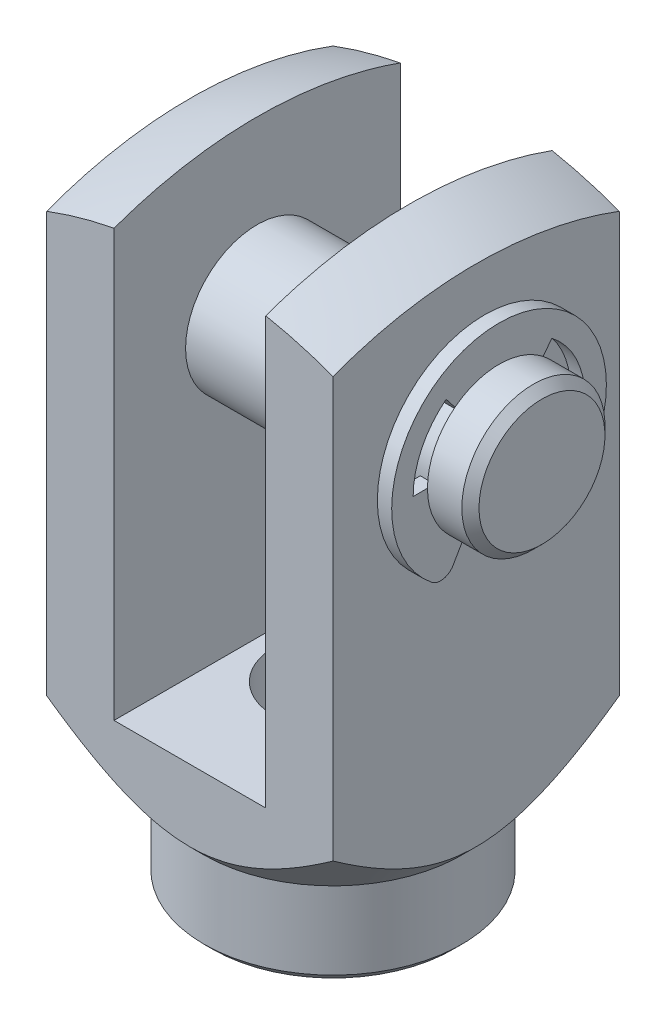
ISO-10303-21;
HEADER;
FILE_DESCRIPTION(('STEP AP214'),'2;1');
FILE_NAME('part.step','',(''),(''),'','','');
FILE_SCHEMA(('AUTOMOTIVE_DESIGN { 1 0 10303 214 1 1 1 1 }'));
ENDSEC;
DATA;
#1=APPLICATION_CONTEXT('core data for automotive mechanical design processes');
#2=APPLICATION_PROTOCOL_DEFINITION('international standard','automotive_design',2000,#1);
#3=PRODUCT_CONTEXT('',#1,'mechanical');
#4=PRODUCT('Part','Part','',(#3));
#5=PRODUCT_RELATED_PRODUCT_CATEGORY('part','',(#4));
#6=PRODUCT_DEFINITION_FORMATION('','',#4);
#7=PRODUCT_DEFINITION_CONTEXT('part definition',#1,'design');
#8=PRODUCT_DEFINITION('design','',#6,#7);
#9=PRODUCT_DEFINITION_SHAPE('','',#8);
#10=(LENGTH_UNIT() NAMED_UNIT(*) SI_UNIT(.MILLI.,.METRE.));
#11=(NAMED_UNIT(*) PLANE_ANGLE_UNIT() SI_UNIT($,.RADIAN.));
#12=(NAMED_UNIT(*) SI_UNIT($,.STERADIAN.) SOLID_ANGLE_UNIT());
#13=UNCERTAINTY_MEASURE_WITH_UNIT(LENGTH_MEASURE(1.E-05),#10,'distance_accuracy_value','');
#14=(GEOMETRIC_REPRESENTATION_CONTEXT(3) GLOBAL_UNCERTAINTY_ASSIGNED_CONTEXT((#13)) GLOBAL_UNIT_ASSIGNED_CONTEXT((#10,
#11,#12)) REPRESENTATION_CONTEXT('',''));
#15=CARTESIAN_POINT('',(0.,0.,0.));
#16=DIRECTION('',(0.,0.,1.));
#17=DIRECTION('',(1.,0.,0.));
#18=AXIS2_PLACEMENT_3D('',#15,#16,#17);
#19=CARTESIAN_POINT('',(-7.3,13.,0.));
#20=DIRECTION('',(1.,0.,0.));
#21=DIRECTION('',(0.,0.,-1.));
#22=AXIS2_PLACEMENT_3D('',#19,#20,#21);
#23=PLANE('',#22);
#24=CARTESIAN_POINT('',(-7.30000000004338,13.,0.));
#25=DIRECTION('',(1.,0.,0.));
#26=DIRECTION('',(0.,1.,0.));
#27=AXIS2_PLACEMENT_3D('',#24,#25,#26);
#28=CIRCLE('',#27,2.20000000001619);
#29=CARTESIAN_POINT('',(-7.30000000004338,15.2000000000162,0.));
#30=VERTEX_POINT('',#29);
#31=EDGE_CURVE('E20',#30,#30,#28,.T.);
#32=ORIENTED_EDGE('',*,*,#31,.F.);
#33=EDGE_LOOP('',(#32));
#34=FACE_BOUND('',#33,.T.);
#35=ADVANCED_FACE('F17',(#34),#23,.F.);
#36=CARTESIAN_POINT('',(-7.00000000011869,13.,0.));
#37=DIRECTION('',(1.,0.,0.));
#38=DIRECTION('',(0.,1.,0.));
#39=AXIS2_PLACEMENT_3D('',#36,#37,#38);
#40=CONICAL_SURFACE('',#39,2.49999999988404,0.785398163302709);
#41=CARTESIAN_POINT('',(-7.,13.,0.));
#42=DIRECTION('',(-1.,0.,0.));
#43=DIRECTION('',(0.,0.,1.));
#44=AXIS2_PLACEMENT_3D('',#41,#42,#43);
#45=CIRCLE('',#44,2.5);
#46=CARTESIAN_POINT('',(-7.,13.,2.5));
#47=VERTEX_POINT('',#46);
#48=EDGE_CURVE('E335',#47,#47,#45,.F.);
#49=ORIENTED_EDGE('',*,*,#48,.F.);
#50=EDGE_LOOP('',(#49));
#51=FACE_BOUND('',#50,.T.);
#52=ORIENTED_EDGE('',*,*,#31,.T.);
#53=EDGE_LOOP('',(#52));
#54=FACE_BOUND('',#53,.T.);
#55=ADVANCED_FACE('F1375',(#51,#54),#40,.T.);
#56=CARTESIAN_POINT('',(-5.8,13.,0.));
#57=DIRECTION('',(1.,0.,0.));
#58=DIRECTION('',(0.,0.,-1.));
#59=AXIS2_PLACEMENT_3D('',#56,#57,#58);
#60=PLANE('',#59);
#61=CARTESIAN_POINT('',(-5.8,13.,0.));
#62=DIRECTION('',(-1.,0.,0.));
#63=DIRECTION('',(0.,0.,1.));
#64=AXIS2_PLACEMENT_3D('',#61,#62,#63);
#65=CIRCLE('',#64,2.5);
#66=CARTESIAN_POINT('',(-5.8,14.9700268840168,1.53915368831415));
#67=VERTEX_POINT('',#66);
#68=CARTESIAN_POINT('',(-5.8,14.9700268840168,-1.53915368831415));
#69=VERTEX_POINT('',#68);
#70=EDGE_CURVE('E313',#67,#69,#65,.T.);
#71=ORIENTED_EDGE('',*,*,#70,.F.);
#72=DIRECTION('',(0.,-0.788010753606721,-0.615661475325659));
#73=VECTOR('',#72,1.);
#74=CARTESIAN_POINT('',(-5.8,15.3640322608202,1.84698442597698));
#75=LINE('',#74,#73);
#76=CARTESIAN_POINT('',(-5.8,15.3640322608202,1.84698442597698));
#77=VERTEX_POINT('',#76);
#78=EDGE_CURVE('E458',#77,#67,#75,.T.);
#79=ORIENTED_EDGE('',*,*,#78,.F.);
#80=CARTESIAN_POINT('',(-5.8,13.,0.));
#81=DIRECTION('',(-1.,0.,0.));
#82=DIRECTION('',(0.,0.,1.));
#83=AXIS2_PLACEMENT_3D('',#80,#81,#82);
#84=CIRCLE('',#83,3.);
#85=CARTESIAN_POINT('',(-5.8,13.,3.));
#86=VERTEX_POINT('',#85);
#87=EDGE_CURVE('E342',#77,#86,#84,.F.);
#88=ORIENTED_EDGE('',*,*,#87,.T.);
#89=DIRECTION('',(0.,0.,-1.));
#90=VECTOR('',#89,1.);
#91=CARTESIAN_POINT('',(-5.8,13.,0.));
#92=LINE('',#91,#90);
#93=CARTESIAN_POINT('',(-5.8,13.,2.5));
#94=VERTEX_POINT('',#93);
#95=EDGE_CURVE('E372',#94,#86,#92,.F.);
#96=ORIENTED_EDGE('',*,*,#95,.F.);
#97=CARTESIAN_POINT('',(-5.8,13.,0.));
#98=DIRECTION('',(-1.,0.,0.));
#99=DIRECTION('',(0.,0.,1.));
#100=AXIS2_PLACEMENT_3D('',#97,#98,#99);
#101=CIRCLE('',#100,2.5);
#102=CARTESIAN_POINT('',(-5.8,10.8349364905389,1.25));
#103=VERTEX_POINT('',#102);
#104=EDGE_CURVE('E299',#103,#94,#101,.T.);
#105=ORIENTED_EDGE('',*,*,#104,.F.);
#106=DIRECTION('',(0.,0.866025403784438,-0.500000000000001));
#107=VECTOR('',#106,1.);
#108=CARTESIAN_POINT('',(-5.8,10.2189255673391,1.60565407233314));
#109=LINE('',#108,#107);
#110=CARTESIAN_POINT('',(-5.8,10.2189255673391,1.60565407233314));
#111=VERTEX_POINT('',#110);
#112=EDGE_CURVE('E461',#111,#103,#109,.T.);
#113=ORIENTED_EDGE('',*,*,#112,.F.);
#114=CARTESIAN_POINT('',(-5.8,10.4689255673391,2.03866677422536));
#115=DIRECTION('',(-1.,0.,0.));
#116=DIRECTION('',(0.,0.,1.));
#117=AXIS2_PLACEMENT_3D('',#114,#115,#116);
#118=CIRCLE('',#117,0.5);
#119=CARTESIAN_POINT('',(-5.8,10.0795295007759,2.35230781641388));
#120=VERTEX_POINT('',#119);
#121=EDGE_CURVE('E346',#120,#111,#118,.F.);
#122=ORIENTED_EDGE('',*,*,#121,.F.);
#123=CARTESIAN_POINT('',(-5.8,13.,0.));
#124=DIRECTION('',(-1.,0.,0.));
#125=DIRECTION('',(0.,0.,1.));
#126=AXIS2_PLACEMENT_3D('',#123,#124,#125);
#127=CIRCLE('',#126,3.75);
#128=CARTESIAN_POINT('',(-5.8,10.0795295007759,-2.35230781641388));
#129=VERTEX_POINT('',#128);
#130=EDGE_CURVE('E350',#129,#120,#127,.F.);
#131=ORIENTED_EDGE('',*,*,#130,.F.);
#132=CARTESIAN_POINT('',(-5.8,10.4689255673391,-2.03866677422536));
#133=DIRECTION('',(-1.,0.,0.));
#134=DIRECTION('',(0.,0.,1.));
#135=AXIS2_PLACEMENT_3D('',#132,#133,#134);
#136=CIRCLE('',#135,0.500000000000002);
#137=CARTESIAN_POINT('',(-5.8,10.2189255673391,-1.60565407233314));
#138=VERTEX_POINT('',#137);
#139=EDGE_CURVE('E336',#138,#129,#136,.F.);
#140=ORIENTED_EDGE('',*,*,#139,.F.);
#141=DIRECTION('',(0.,-0.866025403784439,-0.499999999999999));
#142=VECTOR('',#141,1.);
#143=CARTESIAN_POINT('',(-5.8,10.8349364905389,-1.25));
#144=LINE('',#143,#142);
#145=CARTESIAN_POINT('',(-5.8,10.8349364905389,-1.25));
#146=VERTEX_POINT('',#145);
#147=EDGE_CURVE('E287',#146,#138,#144,.T.);
#148=ORIENTED_EDGE('',*,*,#147,.F.);
#149=CARTESIAN_POINT('',(-5.8,13.,0.));
#150=DIRECTION('',(-1.,0.,0.));
#151=DIRECTION('',(0.,0.,1.));
#152=AXIS2_PLACEMENT_3D('',#149,#150,#151);
#153=CIRCLE('',#152,2.5);
#154=CARTESIAN_POINT('',(-5.8,13.,-2.5));
#155=VERTEX_POINT('',#154);
#156=EDGE_CURVE('E291',#155,#146,#153,.T.);
#157=ORIENTED_EDGE('',*,*,#156,.F.);
#158=DIRECTION('',(0.,0.,-1.));
#159=VECTOR('',#158,1.);
#160=CARTESIAN_POINT('',(-5.8,13.,0.));
#161=LINE('',#160,#159);
#162=CARTESIAN_POINT('',(-5.8,13.,-3.));
#163=VERTEX_POINT('',#162);
#164=EDGE_CURVE('E274',#163,#155,#161,.F.);
#165=ORIENTED_EDGE('',*,*,#164,.F.);
#166=CARTESIAN_POINT('',(-5.8,13.,0.));
#167=DIRECTION('',(-1.,0.,0.));
#168=DIRECTION('',(0.,0.,1.));
#169=AXIS2_PLACEMENT_3D('',#166,#167,#168);
#170=CIRCLE('',#169,2.99999999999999);
#171=CARTESIAN_POINT('',(-5.8,15.3640322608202,-1.84698442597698));
#172=VERTEX_POINT('',#171);
#173=EDGE_CURVE('E340',#163,#172,#170,.F.);
#174=ORIENTED_EDGE('',*,*,#173,.T.);
#175=DIRECTION('',(0.,0.788010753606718,-0.615661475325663));
#176=VECTOR('',#175,1.);
#177=CARTESIAN_POINT('',(-5.8,14.9700268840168,-1.53915368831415));
#178=LINE('',#177,#176);
#179=EDGE_CURVE('E300',#69,#172,#178,.T.);
#180=ORIENTED_EDGE('',*,*,#179,.F.);
#181=EDGE_LOOP('',(#71,#79,#88,#96,#105,#113,#122,#131,#140,#148,#157,#165,#174,#180));
#182=FACE_BOUND('',#181,.T.);
#183=ADVANCED_FACE('F293',(#182),#60,.F.);
#184=CARTESIAN_POINT('',(7.3,15.2,0.));
#185=DIRECTION('',(-1.,0.,0.));
#186=DIRECTION('',(0.,0.,1.));
#187=AXIS2_PLACEMENT_3D('',#184,#185,#186);
#188=PLANE('',#187);
#189=CARTESIAN_POINT('',(7.29999999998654,13.,0.));
#190=DIRECTION('',(-1.,0.,0.));
#191=DIRECTION('',(0.,0.,1.));
#192=AXIS2_PLACEMENT_3D('',#189,#190,#191);
#193=CIRCLE('',#192,2.20000000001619);
#194=CARTESIAN_POINT('',(7.29999999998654,13.,2.20000000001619));
#195=VERTEX_POINT('',#194);
#196=EDGE_CURVE('E330',#195,#195,#193,.T.);
#197=ORIENTED_EDGE('',*,*,#196,.F.);
#198=EDGE_LOOP('',(#197));
#199=FACE_BOUND('',#198,.T.);
#200=ADVANCED_FACE('F1364',(#199),#188,.F.);
#201=CARTESIAN_POINT('',(-5.3,13.,0.));
#202=DIRECTION('',(-1.,0.,0.));
#203=DIRECTION('',(0.,0.,1.));
#204=AXIS2_PLACEMENT_3D('',#201,#202,#203);
#205=CYLINDRICAL_SURFACE('',#204,3.75);
#206=ORIENTED_EDGE('',*,*,#130,.T.);
#207=DIRECTION('',(-1.,0.,0.));
#208=VECTOR('',#207,1.);
#209=CARTESIAN_POINT('',(-5.3,10.0795295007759,2.35230781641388));
#210=LINE('',#209,#208);
#211=CARTESIAN_POINT('',(-5.3,10.0795295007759,2.35230781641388));
#212=VERTEX_POINT('',#211);
#213=EDGE_CURVE('E349',#212,#120,#210,.T.);
#214=ORIENTED_EDGE('',*,*,#213,.F.);
#215=CARTESIAN_POINT('',(-5.3,13.,0.));
#216=DIRECTION('',(-1.,0.,0.));
#217=DIRECTION('',(0.,0.,1.));
#218=AXIS2_PLACEMENT_3D('',#215,#216,#217);
#219=CIRCLE('',#218,3.75);
#220=CARTESIAN_POINT('',(-5.3,10.0795295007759,-2.35230781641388));
#221=VERTEX_POINT('',#220);
#222=EDGE_CURVE('E319',#221,#212,#219,.F.);
#223=ORIENTED_EDGE('',*,*,#222,.F.);
#224=DIRECTION('',(-1.,0.,0.));
#225=VECTOR('',#224,1.);
#226=CARTESIAN_POINT('',(-5.3,10.0795295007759,-2.35230781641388));
#227=LINE('',#226,#225);
#228=EDGE_CURVE('E339',#129,#221,#227,.F.);
#229=ORIENTED_EDGE('',*,*,#228,.F.);
#230=EDGE_LOOP('',(#206,#214,#223,#229));
#231=FACE_BOUND('',#230,.T.);
#232=ADVANCED_FACE('F694',(#231),#205,.T.);
#233=CARTESIAN_POINT('',(-5.3,10.4689255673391,2.03866677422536));
#234=DIRECTION('',(-1.,0.,0.));
#235=DIRECTION('',(0.,0.,1.));
#236=AXIS2_PLACEMENT_3D('',#233,#234,#235);
#237=CYLINDRICAL_SURFACE('',#236,0.5);
#238=CARTESIAN_POINT('',(-5.3,10.4689255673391,2.03866677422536));
#239=DIRECTION('',(-1.,0.,0.));
#240=DIRECTION('',(0.,0.,1.));
#241=AXIS2_PLACEMENT_3D('',#238,#239,#240);
#242=CIRCLE('',#241,0.5);
#243=CARTESIAN_POINT('',(-5.3,10.2189255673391,1.60565407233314));
#244=VERTEX_POINT('',#243);
#245=EDGE_CURVE('E405',#212,#244,#242,.F.);
#246=ORIENTED_EDGE('',*,*,#245,.F.);
#247=ORIENTED_EDGE('',*,*,#213,.T.);
#248=ORIENTED_EDGE('',*,*,#121,.T.);
#249=DIRECTION('',(1.,0.,0.));
#250=VECTOR('',#249,1.);
#251=CARTESIAN_POINT('',(-5.3,10.2189255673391,1.60565407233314));
#252=LINE('',#251,#250);
#253=EDGE_CURVE('E324',#111,#244,#252,.T.);
#254=ORIENTED_EDGE('',*,*,#253,.T.);
#255=EDGE_LOOP('',(#246,#247,#248,#254));
#256=FACE_BOUND('',#255,.T.);
#257=ADVANCED_FACE('F697',(#256),#237,.T.);
#258=CARTESIAN_POINT('',(-5.3,13.,0.));
#259=DIRECTION('',(-1.,0.,0.));
#260=DIRECTION('',(0.,0.,1.));
#261=AXIS2_PLACEMENT_3D('',#258,#259,#260);
#262=CYLINDRICAL_SURFACE('',#261,3.);
#263=DIRECTION('',(-1.,0.,0.));
#264=VECTOR('',#263,1.);
#265=CARTESIAN_POINT('',(-5.3,15.3640322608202,1.84698442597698));
#266=LINE('',#265,#264);
#267=CARTESIAN_POINT('',(-5.3,15.3640322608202,1.84698442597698));
#268=VERTEX_POINT('',#267);
#269=EDGE_CURVE('E345',#268,#77,#266,.T.);
#270=ORIENTED_EDGE('',*,*,#269,.F.);
#271=CARTESIAN_POINT('',(-5.3,13.,0.));
#272=DIRECTION('',(-1.,0.,0.));
#273=DIRECTION('',(0.,0.,1.));
#274=AXIS2_PLACEMENT_3D('',#271,#272,#273);
#275=CIRCLE('',#274,3.);
#276=CARTESIAN_POINT('',(-5.3,13.,3.));
#277=VERTEX_POINT('',#276);
#278=EDGE_CURVE('E402',#277,#268,#275,.T.);
#279=ORIENTED_EDGE('',*,*,#278,.F.);
#280=DIRECTION('',(-1.,0.,0.));
#281=VECTOR('',#280,1.);
#282=CARTESIAN_POINT('',(-5.3,13.,3.));
#283=LINE('',#282,#281);
#284=EDGE_CURVE('E449',#86,#277,#283,.F.);
#285=ORIENTED_EDGE('',*,*,#284,.F.);
#286=ORIENTED_EDGE('',*,*,#87,.F.);
#287=EDGE_LOOP('',(#270,#279,#285,#286));
#288=FACE_BOUND('',#287,.T.);
#289=ADVANCED_FACE('F729',(#288),#262,.F.);
#290=CARTESIAN_POINT('',(-5.3,13.,0.));
#291=DIRECTION('',(-1.,0.,0.));
#292=DIRECTION('',(0.,0.,1.));
#293=AXIS2_PLACEMENT_3D('',#290,#291,#292);
#294=CYLINDRICAL_SURFACE('',#293,2.99999999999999);
#295=DIRECTION('',(1.,0.,0.));
#296=VECTOR('',#295,1.);
#297=CARTESIAN_POINT('',(-5.3,13.,-3.));
#298=LINE('',#297,#296);
#299=CARTESIAN_POINT('',(-5.3,13.,-3.));
#300=VERTEX_POINT('',#299);
#301=EDGE_CURVE('E283',#163,#300,#298,.T.);
#302=ORIENTED_EDGE('',*,*,#301,.T.);
#303=CARTESIAN_POINT('',(-5.3,13.,0.));
#304=DIRECTION('',(-1.,0.,0.));
#305=DIRECTION('',(0.,0.,1.));
#306=AXIS2_PLACEMENT_3D('',#303,#304,#305);
#307=CIRCLE('',#306,2.99999999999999);
#308=CARTESIAN_POINT('',(-5.3,15.3640322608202,-1.84698442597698));
#309=VERTEX_POINT('',#308);
#310=EDGE_CURVE('E398',#309,#300,#307,.T.);
#311=ORIENTED_EDGE('',*,*,#310,.F.);
#312=DIRECTION('',(1.,0.,0.));
#313=VECTOR('',#312,1.);
#314=CARTESIAN_POINT('',(-5.3,15.3640322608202,-1.84698442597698));
#315=LINE('',#314,#313);
#316=EDGE_CURVE('E308',#309,#172,#315,.F.);
#317=ORIENTED_EDGE('',*,*,#316,.T.);
#318=ORIENTED_EDGE('',*,*,#173,.F.);
#319=EDGE_LOOP('',(#302,#311,#317,#318));
#320=FACE_BOUND('',#319,.T.);
#321=ADVANCED_FACE('F718',(#320),#294,.F.);
#322=CARTESIAN_POINT('',(-5.3,10.4689255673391,-2.03866677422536));
#323=DIRECTION('',(-1.,0.,0.));
#324=DIRECTION('',(0.,0.,1.));
#325=AXIS2_PLACEMENT_3D('',#322,#323,#324);
#326=CYLINDRICAL_SURFACE('',#325,0.500000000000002);
#327=CARTESIAN_POINT('',(-5.3,10.4689255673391,-2.03866677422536));
#328=DIRECTION('',(-1.,0.,0.));
#329=DIRECTION('',(0.,0.,1.));
#330=AXIS2_PLACEMENT_3D('',#327,#328,#329);
#331=CIRCLE('',#330,0.500000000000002);
#332=CARTESIAN_POINT('',(-5.3,10.2189255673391,-1.60565407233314));
#333=VERTEX_POINT('',#332);
#334=EDGE_CURVE('E392',#333,#221,#331,.F.);
#335=ORIENTED_EDGE('',*,*,#334,.F.);
#336=DIRECTION('',(1.,0.,0.));
#337=VECTOR('',#336,1.);
#338=CARTESIAN_POINT('',(-5.3,10.2189255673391,-1.60565407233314));
#339=LINE('',#338,#337);
#340=EDGE_CURVE('E418',#333,#138,#339,.F.);
#341=ORIENTED_EDGE('',*,*,#340,.T.);
#342=ORIENTED_EDGE('',*,*,#139,.T.);
#343=ORIENTED_EDGE('',*,*,#228,.T.);
#344=EDGE_LOOP('',(#335,#341,#342,#343));
#345=FACE_BOUND('',#344,.T.);
#346=ADVANCED_FACE('F737',(#345),#326,.T.);
#347=CARTESIAN_POINT('',(7.3,13.,0.));
#348=DIRECTION('',(-1.,0.,0.));
#349=DIRECTION('',(0.,0.,1.));
#350=AXIS2_PLACEMENT_3D('',#347,#348,#349);
#351=CYLINDRICAL_SURFACE('',#350,2.5);
#352=ORIENTED_EDGE('',*,*,#48,.T.);
#353=EDGE_LOOP('',(#352));
#354=FACE_BOUND('',#353,.T.);
#355=CARTESIAN_POINT('',(-5.8,13.,0.));
#356=DIRECTION('',(-1.,0.,0.));
#357=DIRECTION('',(0.,0.,1.));
#358=AXIS2_PLACEMENT_3D('',#355,#356,#357);
#359=CIRCLE('',#358,2.5);
#360=EDGE_CURVE('E355',#94,#67,#359,.T.);
#361=ORIENTED_EDGE('',*,*,#360,.T.);
#362=ORIENTED_EDGE('',*,*,#70,.T.);
#363=CARTESIAN_POINT('',(-5.8,13.,0.));
#364=DIRECTION('',(-1.,0.,0.));
#365=DIRECTION('',(0.,0.,1.));
#366=AXIS2_PLACEMENT_3D('',#363,#364,#365);
#367=CIRCLE('',#366,2.5);
#368=EDGE_CURVE('E305',#69,#155,#367,.T.);
#369=ORIENTED_EDGE('',*,*,#368,.T.);
#370=ORIENTED_EDGE('',*,*,#156,.T.);
#371=CARTESIAN_POINT('',(-5.8,13.,0.));
#372=DIRECTION('',(-1.,0.,0.));
#373=DIRECTION('',(0.,0.,1.));
#374=AXIS2_PLACEMENT_3D('',#371,#372,#373);
#375=CIRCLE('',#374,2.5);
#376=EDGE_CURVE('E321',#146,#103,#375,.T.);
#377=ORIENTED_EDGE('',*,*,#376,.T.);
#378=ORIENTED_EDGE('',*,*,#104,.T.);
#379=EDGE_LOOP('',(#361,#362,#369,#370,#377,#378));
#380=FACE_BOUND('',#379,.T.);
#381=ADVANCED_FACE('F312',(#354,#380),#351,.T.);
#382=CARTESIAN_POINT('',(7.00000000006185,13.,0.));
#383=DIRECTION('',(-1.,0.,0.));
#384=DIRECTION('',(0.,0.,1.));
#385=AXIS2_PLACEMENT_3D('',#382,#383,#384);
#386=CONICAL_SURFACE('',#385,2.49999999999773,0.785398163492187);
#387=ORIENTED_EDGE('',*,*,#196,.T.);
#388=EDGE_LOOP('',(#387));
#389=FACE_BOUND('',#388,.T.);
#390=CARTESIAN_POINT('',(7.,13.,0.));
#391=DIRECTION('',(-1.,0.,0.));
#392=DIRECTION('',(0.,0.,1.));
#393=AXIS2_PLACEMENT_3D('',#390,#391,#392);
#394=CIRCLE('',#393,2.5);
#395=CARTESIAN_POINT('',(7.,13.,2.5));
#396=VERTEX_POINT('',#395);
#397=EDGE_CURVE('E439',#396,#396,#394,.T.);
#398=ORIENTED_EDGE('',*,*,#397,.F.);
#399=EDGE_LOOP('',(#398));
#400=FACE_BOUND('',#399,.T.);
#401=ADVANCED_FACE('F985',(#389,#400),#386,.T.);
#402=CARTESIAN_POINT('',(5.8,13.,0.));
#403=DIRECTION('',(-1.,0.,0.));
#404=DIRECTION('',(0.,0.,1.));
#405=AXIS2_PLACEMENT_3D('',#402,#403,#404);
#406=PLANE('',#405);
#407=CARTESIAN_POINT('',(5.8,13.,0.));
#408=DIRECTION('',(-1.,0.,0.));
#409=DIRECTION('',(0.,0.,1.));
#410=AXIS2_PLACEMENT_3D('',#407,#408,#409);
#411=CIRCLE('',#410,2.5);
#412=CARTESIAN_POINT('',(5.8,14.9700268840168,-1.53915368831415));
#413=VERTEX_POINT('',#412);
#414=CARTESIAN_POINT('',(5.8,14.9700268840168,1.53915368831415));
#415=VERTEX_POINT('',#414);
#416=EDGE_CURVE('E379',#413,#415,#411,.F.);
#417=ORIENTED_EDGE('',*,*,#416,.F.);
#418=DIRECTION('',(0.,-0.788010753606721,0.615661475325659));
#419=VECTOR('',#418,1.);
#420=CARTESIAN_POINT('',(5.8,15.3640322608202,-1.84698442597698));
#421=LINE('',#420,#419);
#422=CARTESIAN_POINT('',(5.8,15.3640322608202,-1.84698442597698));
#423=VERTEX_POINT('',#422);
#424=EDGE_CURVE('E430',#423,#413,#421,.T.);
#425=ORIENTED_EDGE('',*,*,#424,.F.);
#426=CARTESIAN_POINT('',(5.8,13.,0.));
#427=DIRECTION('',(1.,0.,0.));
#428=DIRECTION('',(0.,0.,-1.));
#429=AXIS2_PLACEMENT_3D('',#426,#427,#428);
#430=CIRCLE('',#429,3.);
#431=CARTESIAN_POINT('',(5.8,13.,-3.));
#432=VERTEX_POINT('',#431);
#433=EDGE_CURVE('E652',#423,#432,#430,.F.);
#434=ORIENTED_EDGE('',*,*,#433,.T.);
#435=DIRECTION('',(0.,0.,1.));
#436=VECTOR('',#435,1.);
#437=CARTESIAN_POINT('',(5.8,13.,0.));
#438=LINE('',#437,#436);
#439=CARTESIAN_POINT('',(5.8,13.,-2.5));
#440=VERTEX_POINT('',#439);
#441=EDGE_CURVE('E432',#440,#432,#438,.F.);
#442=ORIENTED_EDGE('',*,*,#441,.F.);
#443=CARTESIAN_POINT('',(5.8,13.,0.));
#444=DIRECTION('',(-1.,0.,0.));
#445=DIRECTION('',(0.,0.,1.));
#446=AXIS2_PLACEMENT_3D('',#443,#444,#445);
#447=CIRCLE('',#446,2.5);
#448=CARTESIAN_POINT('',(5.8,10.8349364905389,-1.25));
#449=VERTEX_POINT('',#448);
#450=EDGE_CURVE('E676',#449,#440,#447,.F.);
#451=ORIENTED_EDGE('',*,*,#450,.F.);
#452=DIRECTION('',(0.,0.866025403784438,0.500000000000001));
#453=VECTOR('',#452,1.);
#454=CARTESIAN_POINT('',(5.8,10.2189255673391,-1.60565407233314));
#455=LINE('',#454,#453);
#456=CARTESIAN_POINT('',(5.8,10.2189255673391,-1.60565407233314));
#457=VERTEX_POINT('',#456);
#458=EDGE_CURVE('E328',#457,#449,#455,.T.);
#459=ORIENTED_EDGE('',*,*,#458,.F.);
#460=CARTESIAN_POINT('',(5.8,10.4689255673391,-2.03866677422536));
#461=DIRECTION('',(1.,0.,0.));
#462=DIRECTION('',(0.,0.,-1.));
#463=AXIS2_PLACEMENT_3D('',#460,#461,#462);
#464=CIRCLE('',#463,0.5);
#465=CARTESIAN_POINT('',(5.8,10.0795295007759,-2.35230781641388));
#466=VERTEX_POINT('',#465);
#467=EDGE_CURVE('E653',#466,#457,#464,.F.);
#468=ORIENTED_EDGE('',*,*,#467,.F.);
#469=CARTESIAN_POINT('',(5.8,13.,0.));
#470=DIRECTION('',(1.,0.,0.));
#471=DIRECTION('',(0.,0.,-1.));
#472=AXIS2_PLACEMENT_3D('',#469,#470,#471);
#473=CIRCLE('',#472,3.75);
#474=CARTESIAN_POINT('',(5.8,10.0795295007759,2.35230781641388));
#475=VERTEX_POINT('',#474);
#476=EDGE_CURVE('E674',#475,#466,#473,.F.);
#477=ORIENTED_EDGE('',*,*,#476,.F.);
#478=CARTESIAN_POINT('',(5.8,10.4689255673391,2.03866677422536));
#479=DIRECTION('',(1.,0.,0.));
#480=DIRECTION('',(0.,0.,-1.));
#481=AXIS2_PLACEMENT_3D('',#478,#479,#480);
#482=CIRCLE('',#481,0.500000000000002);
#483=CARTESIAN_POINT('',(5.8,10.2189255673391,1.60565407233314));
#484=VERTEX_POINT('',#483);
#485=EDGE_CURVE('E325',#484,#475,#482,.F.);
#486=ORIENTED_EDGE('',*,*,#485,.F.);
#487=DIRECTION('',(0.,-0.866025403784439,0.5));
#488=VECTOR('',#487,1.);
#489=CARTESIAN_POINT('',(5.8,10.8349364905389,1.25));
#490=LINE('',#489,#488);
#491=CARTESIAN_POINT('',(5.8,10.8349364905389,1.25));
#492=VERTEX_POINT('',#491);
#493=EDGE_CURVE('E329',#492,#484,#490,.T.);
#494=ORIENTED_EDGE('',*,*,#493,.F.);
#495=CARTESIAN_POINT('',(5.8,13.,0.));
#496=DIRECTION('',(-1.,0.,0.));
#497=DIRECTION('',(0.,0.,1.));
#498=AXIS2_PLACEMENT_3D('',#495,#496,#497);
#499=CIRCLE('',#498,2.5);
#500=CARTESIAN_POINT('',(5.8,13.,2.5));
#501=VERTEX_POINT('',#500);
#502=EDGE_CURVE('E442',#501,#492,#499,.F.);
#503=ORIENTED_EDGE('',*,*,#502,.F.);
#504=DIRECTION('',(0.,0.,1.));
#505=VECTOR('',#504,1.);
#506=CARTESIAN_POINT('',(5.8,13.,0.));
#507=LINE('',#506,#505);
#508=CARTESIAN_POINT('',(5.8,13.,3.));
#509=VERTEX_POINT('',#508);
#510=EDGE_CURVE('E333',#509,#501,#507,.F.);
#511=ORIENTED_EDGE('',*,*,#510,.F.);
#512=CARTESIAN_POINT('',(5.8,13.,0.));
#513=DIRECTION('',(1.,0.,0.));
#514=DIRECTION('',(0.,0.,-1.));
#515=AXIS2_PLACEMENT_3D('',#512,#513,#514);
#516=CIRCLE('',#515,2.99999999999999);
#517=CARTESIAN_POINT('',(5.8,15.3640322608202,1.84698442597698));
#518=VERTEX_POINT('',#517);
#519=EDGE_CURVE('E634',#509,#518,#516,.F.);
#520=ORIENTED_EDGE('',*,*,#519,.T.);
#521=DIRECTION('',(0.,0.788010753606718,0.615661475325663));
#522=VECTOR('',#521,1.);
#523=CARTESIAN_POINT('',(5.8,14.9700268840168,1.53915368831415));
#524=LINE('',#523,#522);
#525=EDGE_CURVE('E428',#415,#518,#524,.T.);
#526=ORIENTED_EDGE('',*,*,#525,.F.);
#527=EDGE_LOOP('',(#417,#425,#434,#442,#451,#459,#468,#477,#486,#494,#503,#511,#520,#526));
#528=FACE_BOUND('',#527,.T.);
#529=ADVANCED_FACE('F894',(#528),#406,.F.);
#530=CARTESIAN_POINT('',(0.,-2.99999999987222,0.));
#531=DIRECTION('',(0.,-1.,0.));
#532=DIRECTION('',(1.,0.,0.));
#533=AXIS2_PLACEMENT_3D('',#530,#531,#532);
#534=CONICAL_SURFACE('',#533,2.49999999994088,0.785398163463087);
#535=CARTESIAN_POINT('',(0.,-2.567,0.));
#536=DIRECTION('',(0.,-1.,0.));
#537=DIRECTION('',(0.,0.,-1.));
#538=AXIS2_PLACEMENT_3D('',#535,#536,#537);
#539=CIRCLE('',#538,2.067);
#540=CARTESIAN_POINT('',(0.,-2.567,-2.067));
#541=VERTEX_POINT('',#540);
#542=EDGE_CURVE('E424',#541,#541,#539,.F.);
#543=ORIENTED_EDGE('',*,*,#542,.T.);
#544=EDGE_LOOP('',(#543));
#545=FACE_BOUND('',#544,.T.);
#546=CARTESIAN_POINT('',(0.,-2.9999999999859,0.));
#547=DIRECTION('',(0.,-1.,0.));
#548=DIRECTION('',(1.,0.,0.));
#549=AXIS2_PLACEMENT_3D('',#546,#547,#548);
#550=CIRCLE('',#549,2.50000000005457);
#551=CARTESIAN_POINT('',(2.50000000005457,-2.9999999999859,0.));
#552=VERTEX_POINT('',#551);
#553=EDGE_CURVE('E375',#552,#552,#550,.T.);
#554=ORIENTED_EDGE('',*,*,#553,.T.);
#555=EDGE_LOOP('',(#554));
#556=FACE_BOUND('',#555,.T.);
#557=ADVANCED_FACE('F979',(#545,#556),#534,.F.);
#558=CARTESIAN_POINT('',(-5.3,10.2189255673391,1.60565407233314));
#559=DIRECTION('',(0.,0.500000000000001,0.866025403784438));
#560=DIRECTION('',(0.,-0.866025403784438,0.500000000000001));
#561=AXIS2_PLACEMENT_3D('',#558,#559,#560);
#562=PLANE('',#561);
#563=DIRECTION('',(0.,0.866025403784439,-0.5));
#564=VECTOR('',#563,1.);
#565=CARTESIAN_POINT('',(-5.8,10.8349364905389,1.25));
#566=LINE('',#565,#564);
#567=CARTESIAN_POINT('',(-5.8,11.051442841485,1.125));
#568=VERTEX_POINT('',#567);
#569=EDGE_CURVE('E323',#103,#568,#566,.T.);
#570=ORIENTED_EDGE('',*,*,#569,.T.);
#571=DIRECTION('',(-1.,0.,0.));
#572=VECTOR('',#571,1.);
#573=CARTESIAN_POINT('',(7.3,11.051442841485,1.125));
#574=LINE('',#573,#572);
#575=CARTESIAN_POINT('',(-5.3,11.051442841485,1.125));
#576=VERTEX_POINT('',#575);
#577=EDGE_CURVE('E421',#576,#568,#574,.T.);
#578=ORIENTED_EDGE('',*,*,#577,.F.);
#579=DIRECTION('',(0.,0.866025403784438,-0.5));
#580=VECTOR('',#579,1.);
#581=CARTESIAN_POINT('',(-5.3,10.2189255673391,1.60565407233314));
#582=LINE('',#581,#580);
#583=EDGE_CURVE('E403',#244,#576,#582,.T.);
#584=ORIENTED_EDGE('',*,*,#583,.F.);
#585=ORIENTED_EDGE('',*,*,#253,.F.);
#586=ORIENTED_EDGE('',*,*,#112,.T.);
#587=EDGE_LOOP('',(#570,#578,#584,#585,#586));
#588=FACE_BOUND('',#587,.T.);
#589=ADVANCED_FACE('F702',(#588),#562,.F.);
#590=CARTESIAN_POINT('',(-5.8,15.5,0.));
#591=DIRECTION('',(-1.,0.,0.));
#592=DIRECTION('',(0.,0.,1.));
#593=AXIS2_PLACEMENT_3D('',#590,#591,#592);
#594=PLANE('',#593);
#595=ORIENTED_EDGE('',*,*,#376,.F.);
#596=DIRECTION('',(0.,0.866025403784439,0.499999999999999));
#597=VECTOR('',#596,1.);
#598=CARTESIAN_POINT('',(-5.8,11.051442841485,-1.125));
#599=LINE('',#598,#597);
#600=CARTESIAN_POINT('',(-5.8,11.051442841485,-1.125));
#601=VERTEX_POINT('',#600);
#602=EDGE_CURVE('E315',#146,#601,#599,.T.);
#603=ORIENTED_EDGE('',*,*,#602,.T.);
#604=CARTESIAN_POINT('',(-5.8,13.,0.));
#605=DIRECTION('',(-1.,0.,0.));
#606=DIRECTION('',(0.,0.,1.));
#607=AXIS2_PLACEMENT_3D('',#604,#605,#606);
#608=CIRCLE('',#607,2.25);
#609=EDGE_CURVE('E415',#568,#601,#608,.F.);
#610=ORIENTED_EDGE('',*,*,#609,.F.);
#611=ORIENTED_EDGE('',*,*,#569,.F.);
#612=EDGE_LOOP('',(#595,#603,#610,#611));
#613=FACE_BOUND('',#612,.T.);
#614=ADVANCED_FACE('F707',(#613),#594,.F.);
#615=CARTESIAN_POINT('',(-5.3,11.051442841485,-1.125));
#616=DIRECTION('',(0.,0.499999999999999,-0.866025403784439));
#617=DIRECTION('',(0.,0.866025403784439,0.499999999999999));
#618=AXIS2_PLACEMENT_3D('',#615,#616,#617);
#619=PLANE('',#618);
#620=ORIENTED_EDGE('',*,*,#147,.T.);
#621=ORIENTED_EDGE('',*,*,#340,.F.);
#622=DIRECTION('',(0.,-0.86602540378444,-0.499999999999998));
#623=VECTOR('',#622,1.);
#624=CARTESIAN_POINT('',(-5.3,11.051442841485,-1.125));
#625=LINE('',#624,#623);
#626=CARTESIAN_POINT('',(-5.3,11.051442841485,-1.125));
#627=VERTEX_POINT('',#626);
#628=EDGE_CURVE('E393',#627,#333,#625,.T.);
#629=ORIENTED_EDGE('',*,*,#628,.F.);
#630=DIRECTION('',(-1.,0.,0.));
#631=VECTOR('',#630,1.);
#632=CARTESIAN_POINT('',(7.3,11.051442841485,-1.125));
#633=LINE('',#632,#631);
#634=EDGE_CURVE('E413',#601,#627,#633,.F.);
#635=ORIENTED_EDGE('',*,*,#634,.F.);
#636=ORIENTED_EDGE('',*,*,#602,.F.);
#637=EDGE_LOOP('',(#620,#621,#629,#635,#636));
#638=FACE_BOUND('',#637,.T.);
#639=ADVANCED_FACE('F712',(#638),#619,.F.);
#640=CARTESIAN_POINT('',(-5.3,13.,-3.));
#641=DIRECTION('',(0.,-1.,0.));
#642=DIRECTION('',(0.,0.,-1.));
#643=AXIS2_PLACEMENT_3D('',#640,#641,#642);
#644=PLANE('',#643);
#645=DIRECTION('',(0.,0.,1.));
#646=VECTOR('',#645,1.);
#647=CARTESIAN_POINT('',(-5.8,13.,0.));
#648=LINE('',#647,#646);
#649=CARTESIAN_POINT('',(-5.8,13.,-2.25));
#650=VERTEX_POINT('',#649);
#651=EDGE_CURVE('E279',#155,#650,#648,.T.);
#652=ORIENTED_EDGE('',*,*,#651,.T.);
#653=DIRECTION('',(-1.,0.,0.));
#654=VECTOR('',#653,1.);
#655=CARTESIAN_POINT('',(7.3,13.,-2.25));
#656=LINE('',#655,#654);
#657=CARTESIAN_POINT('',(-5.3,13.,-2.25));
#658=VERTEX_POINT('',#657);
#659=EDGE_CURVE('E410',#658,#650,#656,.T.);
#660=ORIENTED_EDGE('',*,*,#659,.F.);
#661=DIRECTION('',(0.,0.,-1.));
#662=VECTOR('',#661,1.);
#663=CARTESIAN_POINT('',(-5.3,13.,0.));
#664=LINE('',#663,#662);
#665=EDGE_CURVE('E396',#300,#658,#664,.F.);
#666=ORIENTED_EDGE('',*,*,#665,.F.);
#667=ORIENTED_EDGE('',*,*,#301,.F.);
#668=ORIENTED_EDGE('',*,*,#164,.T.);
#669=EDGE_LOOP('',(#652,#660,#666,#667,#668));
#670=FACE_BOUND('',#669,.T.);
#671=ADVANCED_FACE('F276',(#670),#644,.F.);
#672=CARTESIAN_POINT('',(-5.8,15.5,0.));
#673=DIRECTION('',(-1.,0.,0.));
#674=DIRECTION('',(0.,0.,1.));
#675=AXIS2_PLACEMENT_3D('',#672,#673,#674);
#676=PLANE('',#675);
#677=CARTESIAN_POINT('',(-5.8,13.,0.));
#678=DIRECTION('',(-1.,0.,0.));
#679=DIRECTION('',(0.,0.,1.));
#680=AXIS2_PLACEMENT_3D('',#677,#678,#679);
#681=CIRCLE('',#680,2.25);
#682=CARTESIAN_POINT('',(-5.8,14.7730241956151,-1.38523831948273));
#683=VERTEX_POINT('',#682);
#684=EDGE_CURVE('E307',#650,#683,#681,.F.);
#685=ORIENTED_EDGE('',*,*,#684,.F.);
#686=ORIENTED_EDGE('',*,*,#651,.F.);
#687=ORIENTED_EDGE('',*,*,#368,.F.);
#688=DIRECTION('',(0.,-0.788010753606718,0.615661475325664));
#689=VECTOR('',#688,1.);
#690=CARTESIAN_POINT('',(-5.8,14.7730241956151,-1.38523831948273));
#691=LINE('',#690,#689);
#692=EDGE_CURVE('E408',#69,#683,#691,.T.);
#693=ORIENTED_EDGE('',*,*,#692,.T.);
#694=EDGE_LOOP('',(#685,#686,#687,#693));
#695=FACE_BOUND('',#694,.T.);
#696=ADVANCED_FACE('F303',(#695),#676,.F.);
#697=CARTESIAN_POINT('',(-5.3,14.7730241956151,-1.38523831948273));
#698=DIRECTION('',(0.,0.615661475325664,0.788010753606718));
#699=DIRECTION('',(0.,-0.788010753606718,0.615661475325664));
#700=AXIS2_PLACEMENT_3D('',#697,#698,#699);
#701=PLANE('',#700);
#702=ORIENTED_EDGE('',*,*,#179,.T.);
#703=ORIENTED_EDGE('',*,*,#316,.F.);
#704=DIRECTION('',(0.,0.788010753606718,-0.615661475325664));
#705=VECTOR('',#704,1.);
#706=CARTESIAN_POINT('',(-5.3,14.7730241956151,-1.38523831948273));
#707=LINE('',#706,#705);
#708=CARTESIAN_POINT('',(-5.3,14.7730241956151,-1.38523831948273));
#709=VERTEX_POINT('',#708);
#710=EDGE_CURVE('E399',#709,#309,#707,.T.);
#711=ORIENTED_EDGE('',*,*,#710,.F.);
#712=DIRECTION('',(-1.,0.,0.));
#713=VECTOR('',#712,1.);
#714=CARTESIAN_POINT('',(7.3,14.7730241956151,-1.38523831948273));
#715=LINE('',#714,#713);
#716=EDGE_CURVE('E406',#683,#709,#715,.F.);
#717=ORIENTED_EDGE('',*,*,#716,.F.);
#718=ORIENTED_EDGE('',*,*,#692,.F.);
#719=EDGE_LOOP('',(#702,#703,#711,#717,#718));
#720=FACE_BOUND('',#719,.T.);
#721=ADVANCED_FACE('F720',(#720),#701,.F.);
#722=CARTESIAN_POINT('',(-5.3,13.,0.));
#723=DIRECTION('',(1.,0.,0.));
#724=DIRECTION('',(0.,0.,-1.));
#725=AXIS2_PLACEMENT_3D('',#722,#723,#724);
#726=PLANE('',#725);
#727=ORIENTED_EDGE('',*,*,#628,.T.);
#728=ORIENTED_EDGE('',*,*,#334,.T.);
#729=ORIENTED_EDGE('',*,*,#222,.T.);
#730=ORIENTED_EDGE('',*,*,#245,.T.);
#731=ORIENTED_EDGE('',*,*,#583,.T.);
#732=CARTESIAN_POINT('',(-5.3,13.,0.));
#733=DIRECTION('',(-1.,0.,0.));
#734=DIRECTION('',(0.,0.,1.));
#735=AXIS2_PLACEMENT_3D('',#732,#733,#734);
#736=CIRCLE('',#735,2.25);
#737=CARTESIAN_POINT('',(-5.3,13.,2.25));
#738=VERTEX_POINT('',#737);
#739=EDGE_CURVE('E423',#738,#576,#736,.F.);
#740=ORIENTED_EDGE('',*,*,#739,.F.);
#741=DIRECTION('',(0.,0.,-1.));
#742=VECTOR('',#741,1.);
#743=CARTESIAN_POINT('',(-5.3,13.,2.25));
#744=LINE('',#743,#742);
#745=EDGE_CURVE('E376',#738,#277,#744,.F.);
#746=ORIENTED_EDGE('',*,*,#745,.T.);
#747=ORIENTED_EDGE('',*,*,#278,.T.);
#748=DIRECTION('',(0.,0.788010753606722,0.615661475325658));
#749=VECTOR('',#748,1.);
#750=CARTESIAN_POINT('',(-5.3,15.3640322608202,1.84698442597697));
#751=LINE('',#750,#749);
#752=CARTESIAN_POINT('',(-5.3,14.7730241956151,1.38523831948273));
#753=VERTEX_POINT('',#752);
#754=EDGE_CURVE('E367',#268,#753,#751,.F.);
#755=ORIENTED_EDGE('',*,*,#754,.T.);
#756=CARTESIAN_POINT('',(-5.3,13.,0.));
#757=DIRECTION('',(-1.,0.,0.));
#758=DIRECTION('',(0.,0.,1.));
#759=AXIS2_PLACEMENT_3D('',#756,#757,#758);
#760=CIRCLE('',#759,2.25);
#761=EDGE_CURVE('E389',#709,#753,#760,.F.);
#762=ORIENTED_EDGE('',*,*,#761,.F.);
#763=ORIENTED_EDGE('',*,*,#710,.T.);
#764=ORIENTED_EDGE('',*,*,#310,.T.);
#765=ORIENTED_EDGE('',*,*,#665,.T.);
#766=CARTESIAN_POINT('',(-5.3,13.,0.));
#767=DIRECTION('',(-1.,0.,0.));
#768=DIRECTION('',(0.,0.,1.));
#769=AXIS2_PLACEMENT_3D('',#766,#767,#768);
#770=CIRCLE('',#769,2.25);
#771=EDGE_CURVE('E412',#627,#658,#770,.F.);
#772=ORIENTED_EDGE('',*,*,#771,.F.);
#773=EDGE_LOOP('',(#727,#728,#729,#730,#731,#740,#746,#747,#755,#762,#763,#764,#765,#772));
#774=FACE_BOUND('',#773,.T.);
#775=ADVANCED_FACE('F690',(#774),#726,.T.);
#776=CARTESIAN_POINT('',(-5.3,15.3640322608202,1.84698442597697));
#777=DIRECTION('',(0.,0.615661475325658,-0.788010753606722));
#778=DIRECTION('',(0.,0.788010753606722,0.615661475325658));
#779=AXIS2_PLACEMENT_3D('',#776,#777,#778);
#780=PLANE('',#779);
#781=DIRECTION('',(0.,-0.788010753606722,-0.615661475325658));
#782=VECTOR('',#781,1.);
#783=CARTESIAN_POINT('',(-5.8,14.9700268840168,1.53915368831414));
#784=LINE('',#783,#782);
#785=CARTESIAN_POINT('',(-5.8,14.7730241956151,1.38523831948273));
#786=VERTEX_POINT('',#785);
#787=EDGE_CURVE('E366',#67,#786,#784,.T.);
#788=ORIENTED_EDGE('',*,*,#787,.T.);
#789=DIRECTION('',(-1.,0.,0.));
#790=VECTOR('',#789,1.);
#791=CARTESIAN_POINT('',(7.3,14.7730241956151,1.38523831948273));
#792=LINE('',#791,#790);
#793=EDGE_CURVE('E386',#753,#786,#792,.T.);
#794=ORIENTED_EDGE('',*,*,#793,.F.);
#795=ORIENTED_EDGE('',*,*,#754,.F.);
#796=ORIENTED_EDGE('',*,*,#269,.T.);
#797=ORIENTED_EDGE('',*,*,#78,.T.);
#798=EDGE_LOOP('',(#788,#794,#795,#796,#797));
#799=FACE_BOUND('',#798,.T.);
#800=ADVANCED_FACE('F726',(#799),#780,.F.);
#801=CARTESIAN_POINT('',(-5.8,15.5,0.));
#802=DIRECTION('',(-1.,0.,0.));
#803=DIRECTION('',(0.,0.,1.));
#804=AXIS2_PLACEMENT_3D('',#801,#802,#803);
#805=PLANE('',#804);
#806=CARTESIAN_POINT('',(-5.8,13.,0.));
#807=DIRECTION('',(-1.,0.,0.));
#808=DIRECTION('',(0.,0.,1.));
#809=AXIS2_PLACEMENT_3D('',#806,#807,#808);
#810=CIRCLE('',#809,2.25);
#811=CARTESIAN_POINT('',(-5.8,13.,2.25));
#812=VERTEX_POINT('',#811);
#813=EDGE_CURVE('E388',#786,#812,#810,.F.);
#814=ORIENTED_EDGE('',*,*,#813,.F.);
#815=ORIENTED_EDGE('',*,*,#787,.F.);
#816=ORIENTED_EDGE('',*,*,#360,.F.);
#817=DIRECTION('',(0.,0.,-1.));
#818=VECTOR('',#817,1.);
#819=CARTESIAN_POINT('',(-5.8,13.,2.25));
#820=LINE('',#819,#818);
#821=EDGE_CURVE('E363',#94,#812,#820,.T.);
#822=ORIENTED_EDGE('',*,*,#821,.T.);
#823=EDGE_LOOP('',(#814,#815,#816,#822));
#824=FACE_BOUND('',#823,.T.);
#825=ADVANCED_FACE('F362',(#824),#805,.F.);
#826=CARTESIAN_POINT('',(-5.3,13.,2.25));
#827=DIRECTION('',(0.,-1.,0.));
#828=DIRECTION('',(0.,0.,-1.));
#829=AXIS2_PLACEMENT_3D('',#826,#827,#828);
#830=PLANE('',#829);
#831=ORIENTED_EDGE('',*,*,#95,.T.);
#832=ORIENTED_EDGE('',*,*,#284,.T.);
#833=ORIENTED_EDGE('',*,*,#745,.F.);
#834=DIRECTION('',(-1.,0.,0.));
#835=VECTOR('',#834,1.);
#836=CARTESIAN_POINT('',(7.3,13.,2.25));
#837=LINE('',#836,#835);
#838=EDGE_CURVE('E374',#812,#738,#837,.F.);
#839=ORIENTED_EDGE('',*,*,#838,.F.);
#840=ORIENTED_EDGE('',*,*,#821,.F.);
#841=EDGE_LOOP('',(#831,#832,#833,#839,#840));
#842=FACE_BOUND('',#841,.T.);
#843=ADVANCED_FACE('F371',(#842),#830,.F.);
#844=CARTESIAN_POINT('',(0.,-3.,0.));
#845=DIRECTION('',(0.,1.,0.));
#846=DIRECTION('',(0.,0.,1.));
#847=AXIS2_PLACEMENT_3D('',#844,#845,#846);
#848=PLANE('',#847);
#849=ORIENTED_EDGE('',*,*,#553,.F.);
#850=EDGE_LOOP('',(#849));
#851=FACE_BOUND('',#850,.T.);
#852=CARTESIAN_POINT('',(0.,-3.00000000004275,0.));
#853=DIRECTION('',(0.,1.,0.));
#854=DIRECTION('',(0.,0.,1.));
#855=AXIS2_PLACEMENT_3D('',#852,#853,#854);
#856=CIRCLE('',#855,4.1999999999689);
#857=CARTESIAN_POINT('',(0.,-3.00000000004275,4.1999999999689));
#858=VERTEX_POINT('',#857);
#859=EDGE_CURVE('E647',#858,#858,#856,.T.);
#860=ORIENTED_EDGE('',*,*,#859,.F.);
#861=EDGE_LOOP('',(#860));
#862=FACE_BOUND('',#861,.T.);
#863=ADVANCED_FACE('F954',(#851,#862),#848,.F.);
#864=CARTESIAN_POINT('',(7.3,13.,0.));
#865=DIRECTION('',(-1.,0.,0.));
#866=DIRECTION('',(0.,0.,1.));
#867=AXIS2_PLACEMENT_3D('',#864,#865,#866);
#868=CYLINDRICAL_SURFACE('',#867,2.5);
#869=ORIENTED_EDGE('',*,*,#397,.T.);
#870=EDGE_LOOP('',(#869));
#871=FACE_BOUND('',#870,.T.);
#872=CARTESIAN_POINT('',(5.8,13.,0.));
#873=DIRECTION('',(-1.,0.,0.));
#874=DIRECTION('',(0.,0.,1.));
#875=AXIS2_PLACEMENT_3D('',#872,#873,#874);
#876=CIRCLE('',#875,2.5);
#877=EDGE_CURVE('E600',#492,#449,#876,.F.);
#878=ORIENTED_EDGE('',*,*,#877,.T.);
#879=ORIENTED_EDGE('',*,*,#450,.T.);
#880=CARTESIAN_POINT('',(5.8,13.,0.));
#881=DIRECTION('',(-1.,0.,0.));
#882=DIRECTION('',(0.,0.,1.));
#883=AXIS2_PLACEMENT_3D('',#880,#881,#882);
#884=CIRCLE('',#883,2.5);
#885=EDGE_CURVE('E612',#440,#413,#884,.F.);
#886=ORIENTED_EDGE('',*,*,#885,.T.);
#887=ORIENTED_EDGE('',*,*,#416,.T.);
#888=CARTESIAN_POINT('',(5.8,13.,0.));
#889=DIRECTION('',(-1.,0.,0.));
#890=DIRECTION('',(0.,0.,1.));
#891=AXIS2_PLACEMENT_3D('',#888,#889,#890);
#892=CIRCLE('',#891,2.5);
#893=EDGE_CURVE('E627',#415,#501,#892,.F.);
#894=ORIENTED_EDGE('',*,*,#893,.T.);
#895=ORIENTED_EDGE('',*,*,#502,.T.);
#896=EDGE_LOOP('',(#878,#879,#886,#887,#894,#895));
#897=FACE_BOUND('',#896,.T.);
#898=ADVANCED_FACE('F880',(#871,#897),#868,.T.);
#899=CARTESIAN_POINT('',(5.3,13.,0.));
#900=DIRECTION('',(1.,0.,0.));
#901=DIRECTION('',(0.,0.,-1.));
#902=AXIS2_PLACEMENT_3D('',#899,#900,#901);
#903=CYLINDRICAL_SURFACE('',#902,3.75);
#904=ORIENTED_EDGE('',*,*,#476,.T.);
#905=DIRECTION('',(1.,0.,0.));
#906=VECTOR('',#905,1.);
#907=CARTESIAN_POINT('',(5.3,10.0795295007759,-2.35230781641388));
#908=LINE('',#907,#906);
#909=CARTESIAN_POINT('',(5.3,10.0795295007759,-2.35230781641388));
#910=VERTEX_POINT('',#909);
#911=EDGE_CURVE('E650',#910,#466,#908,.T.);
#912=ORIENTED_EDGE('',*,*,#911,.F.);
#913=CARTESIAN_POINT('',(5.3,13.,0.));
#914=DIRECTION('',(1.,0.,0.));
#915=DIRECTION('',(0.,0.,-1.));
#916=AXIS2_PLACEMENT_3D('',#913,#914,#915);
#917=CIRCLE('',#916,3.75);
#918=CARTESIAN_POINT('',(5.3,10.0795295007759,2.35230781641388));
#919=VERTEX_POINT('',#918);
#920=EDGE_CURVE('E595',#919,#910,#917,.F.);
#921=ORIENTED_EDGE('',*,*,#920,.F.);
#922=DIRECTION('',(1.,0.,0.));
#923=VECTOR('',#922,1.);
#924=CARTESIAN_POINT('',(5.3,10.0795295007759,2.35230781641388));
#925=LINE('',#924,#923);
#926=EDGE_CURVE('E427',#475,#919,#925,.F.);
#927=ORIENTED_EDGE('',*,*,#926,.F.);
#928=EDGE_LOOP('',(#904,#912,#921,#927));
#929=FACE_BOUND('',#928,.T.);
#930=ADVANCED_FACE('F947',(#929),#903,.T.);
#931=CARTESIAN_POINT('',(5.3,10.4689255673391,-2.03866677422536));
#932=DIRECTION('',(1.,0.,0.));
#933=DIRECTION('',(0.,0.,-1.));
#934=AXIS2_PLACEMENT_3D('',#931,#932,#933);
#935=CYLINDRICAL_SURFACE('',#934,0.5);
#936=CARTESIAN_POINT('',(5.3,10.4689255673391,-2.03866677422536));
#937=DIRECTION('',(1.,0.,0.));
#938=DIRECTION('',(0.,0.,-1.));
#939=AXIS2_PLACEMENT_3D('',#936,#937,#938);
#940=CIRCLE('',#939,0.5);
#941=CARTESIAN_POINT('',(5.3,10.2189255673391,-1.60565407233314));
#942=VERTEX_POINT('',#941);
#943=EDGE_CURVE('E587',#910,#942,#940,.F.);
#944=ORIENTED_EDGE('',*,*,#943,.F.);
#945=ORIENTED_EDGE('',*,*,#911,.T.);
#946=ORIENTED_EDGE('',*,*,#467,.T.);
#947=DIRECTION('',(1.,0.,0.));
#948=VECTOR('',#947,1.);
#949=CARTESIAN_POINT('',(5.3,10.2189255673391,-1.60565407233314));
#950=LINE('',#949,#948);
#951=EDGE_CURVE('E608',#457,#942,#950,.F.);
#952=ORIENTED_EDGE('',*,*,#951,.T.);
#953=EDGE_LOOP('',(#944,#945,#946,#952));
#954=FACE_BOUND('',#953,.T.);
#955=ADVANCED_FACE('F940',(#954),#935,.T.);
#956=CARTESIAN_POINT('',(5.3,13.,0.));
#957=DIRECTION('',(1.,0.,0.));
#958=DIRECTION('',(0.,0.,-1.));
#959=AXIS2_PLACEMENT_3D('',#956,#957,#958);
#960=CYLINDRICAL_SURFACE('',#959,3.);
#961=DIRECTION('',(1.,0.,0.));
#962=VECTOR('',#961,1.);
#963=CARTESIAN_POINT('',(5.3,15.3640322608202,-1.84698442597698));
#964=LINE('',#963,#962);
#965=CARTESIAN_POINT('',(5.3,15.3640322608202,-1.84698442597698));
#966=VERTEX_POINT('',#965);
#967=EDGE_CURVE('E622',#423,#966,#964,.F.);
#968=ORIENTED_EDGE('',*,*,#967,.T.);
#969=CARTESIAN_POINT('',(5.3,13.,0.));
#970=DIRECTION('',(1.,0.,0.));
#971=DIRECTION('',(0.,0.,-1.));
#972=AXIS2_PLACEMENT_3D('',#969,#970,#971);
#973=CIRCLE('',#972,3.);
#974=CARTESIAN_POINT('',(5.3,13.,-3.));
#975=VERTEX_POINT('',#974);
#976=EDGE_CURVE('E581',#975,#966,#973,.T.);
#977=ORIENTED_EDGE('',*,*,#976,.F.);
#978=DIRECTION('',(1.,0.,0.));
#979=VECTOR('',#978,1.);
#980=CARTESIAN_POINT('',(5.3,13.,-3.));
#981=LINE('',#980,#979);
#982=EDGE_CURVE('E640',#975,#432,#981,.T.);
#983=ORIENTED_EDGE('',*,*,#982,.T.);
#984=ORIENTED_EDGE('',*,*,#433,.F.);
#985=EDGE_LOOP('',(#968,#977,#983,#984));
#986=FACE_BOUND('',#985,.T.);
#987=ADVANCED_FACE('F931',(#986),#960,.F.);
#988=CARTESIAN_POINT('',(5.3,13.,0.));
#989=DIRECTION('',(1.,0.,0.));
#990=DIRECTION('',(0.,0.,-1.));
#991=AXIS2_PLACEMENT_3D('',#988,#989,#990);
#992=CYLINDRICAL_SURFACE('',#991,2.99999999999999);
#993=DIRECTION('',(1.,0.,0.));
#994=VECTOR('',#993,1.);
#995=CARTESIAN_POINT('',(5.3,13.,3.));
#996=LINE('',#995,#994);
#997=CARTESIAN_POINT('',(5.3,13.,3.));
#998=VERTEX_POINT('',#997);
#999=EDGE_CURVE('E637',#509,#998,#996,.F.);
#1000=ORIENTED_EDGE('',*,*,#999,.T.);
#1001=CARTESIAN_POINT('',(5.3,13.,0.));
#1002=DIRECTION('',(1.,0.,0.));
#1003=DIRECTION('',(0.,0.,-1.));
#1004=AXIS2_PLACEMENT_3D('',#1001,#1002,#1003);
#1005=CIRCLE('',#1004,2.99999999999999);
#1006=CARTESIAN_POINT('',(5.3,15.3640322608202,1.84698442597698));
#1007=VERTEX_POINT('',#1006);
#1008=EDGE_CURVE('E575',#1007,#998,#1005,.T.);
#1009=ORIENTED_EDGE('',*,*,#1008,.F.);
#1010=DIRECTION('',(1.,0.,0.));
#1011=VECTOR('',#1010,1.);
#1012=CARTESIAN_POINT('',(5.3,15.3640322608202,1.84698442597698));
#1013=LINE('',#1012,#1011);
#1014=EDGE_CURVE('E623',#1007,#518,#1013,.T.);
#1015=ORIENTED_EDGE('',*,*,#1014,.T.);
#1016=ORIENTED_EDGE('',*,*,#519,.F.);
#1017=EDGE_LOOP('',(#1000,#1009,#1015,#1016));
#1018=FACE_BOUND('',#1017,.T.);
#1019=ADVANCED_FACE('F928',(#1018),#992,.F.);
#1020=CARTESIAN_POINT('',(5.3,10.4689255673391,2.03866677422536));
#1021=DIRECTION('',(1.,0.,0.));
#1022=DIRECTION('',(0.,0.,-1.));
#1023=AXIS2_PLACEMENT_3D('',#1020,#1021,#1022);
#1024=CYLINDRICAL_SURFACE('',#1023,0.500000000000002);
#1025=CARTESIAN_POINT('',(5.3,10.4689255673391,2.03866677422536));
#1026=DIRECTION('',(1.,0.,0.));
#1027=DIRECTION('',(0.,0.,-1.));
#1028=AXIS2_PLACEMENT_3D('',#1025,#1026,#1027);
#1029=CIRCLE('',#1028,0.500000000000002);
#1030=CARTESIAN_POINT('',(5.3,10.2189255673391,1.60565407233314));
#1031=VERTEX_POINT('',#1030);
#1032=EDGE_CURVE('E572',#1031,#919,#1029,.F.);
#1033=ORIENTED_EDGE('',*,*,#1032,.F.);
#1034=DIRECTION('',(1.,0.,0.));
#1035=VECTOR('',#1034,1.);
#1036=CARTESIAN_POINT('',(5.3,10.2189255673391,1.60565407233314));
#1037=LINE('',#1036,#1035);
#1038=EDGE_CURVE('E596',#1031,#484,#1037,.T.);
#1039=ORIENTED_EDGE('',*,*,#1038,.T.);
#1040=ORIENTED_EDGE('',*,*,#485,.T.);
#1041=ORIENTED_EDGE('',*,*,#926,.T.);
#1042=EDGE_LOOP('',(#1033,#1039,#1040,#1041));
#1043=FACE_BOUND('',#1042,.T.);
#1044=ADVANCED_FACE('F930',(#1043),#1024,.T.);
#1045=CARTESIAN_POINT('',(0.,3.,0.));
#1046=DIRECTION('',(0.,-1.,0.));
#1047=DIRECTION('',(0.,0.,-1.));
#1048=AXIS2_PLACEMENT_3D('',#1045,#1046,#1047);
#1049=CYLINDRICAL_SURFACE('',#1048,2.067);
#1050=CARTESIAN_POINT('',(0.,3.,0.));
#1051=DIRECTION('',(0.,-1.,0.));
#1052=DIRECTION('',(0.,0.,-1.));
#1053=AXIS2_PLACEMENT_3D('',#1050,#1051,#1052);
#1054=CIRCLE('',#1053,2.067);
#1055=CARTESIAN_POINT('',(0.,3.,-2.067));
#1056=VERTEX_POINT('',#1055);
#1057=EDGE_CURVE('E542',#1056,#1056,#1054,.F.);
#1058=ORIENTED_EDGE('',*,*,#1057,.T.);
#1059=EDGE_LOOP('',(#1058));
#1060=FACE_BOUND('',#1059,.T.);
#1061=ORIENTED_EDGE('',*,*,#542,.F.);
#1062=EDGE_LOOP('',(#1061));
#1063=FACE_BOUND('',#1062,.T.);
#1064=ADVANCED_FACE('F937',(#1060,#1063),#1049,.F.);
#1065=CARTESIAN_POINT('',(7.3,13.,0.));
#1066=DIRECTION('',(-1.,0.,0.));
#1067=DIRECTION('',(0.,0.,1.));
#1068=AXIS2_PLACEMENT_3D('',#1065,#1066,#1067);
#1069=CYLINDRICAL_SURFACE('',#1068,2.5);
#1070=CARTESIAN_POINT('',(2.65,13.,0.));
#1071=DIRECTION('',(-1.,0.,0.));
#1072=DIRECTION('',(0.,0.,1.));
#1073=AXIS2_PLACEMENT_3D('',#1070,#1071,#1072);
#1074=CIRCLE('',#1073,2.5);
#1075=CARTESIAN_POINT('',(2.65,13.,2.5));
#1076=VERTEX_POINT('',#1075);
#1077=EDGE_CURVE('E555',#1076,#1076,#1074,.T.);
#1078=ORIENTED_EDGE('',*,*,#1077,.T.);
#1079=EDGE_LOOP('',(#1078));
#1080=FACE_BOUND('',#1079,.T.);
#1081=CARTESIAN_POINT('',(-2.65,13.,0.));
#1082=DIRECTION('',(-1.,0.,0.));
#1083=DIRECTION('',(0.,0.,1.));
#1084=AXIS2_PLACEMENT_3D('',#1081,#1082,#1083);
#1085=CIRCLE('',#1084,2.5);
#1086=CARTESIAN_POINT('',(-2.65,13.,2.5));
#1087=VERTEX_POINT('',#1086);
#1088=EDGE_CURVE('E541',#1087,#1087,#1085,.F.);
#1089=ORIENTED_EDGE('',*,*,#1088,.T.);
#1090=EDGE_LOOP('',(#1089));
#1091=FACE_BOUND('',#1090,.T.);
#1092=ADVANCED_FACE('F1100',(#1080,#1091),#1069,.T.);
#1093=CARTESIAN_POINT('',(7.3,13.,0.));
#1094=DIRECTION('',(-1.,0.,0.));
#1095=DIRECTION('',(0.,0.,1.));
#1096=AXIS2_PLACEMENT_3D('',#1093,#1094,#1095);
#1097=CYLINDRICAL_SURFACE('',#1096,2.25);
#1098=ORIENTED_EDGE('',*,*,#771,.T.);
#1099=ORIENTED_EDGE('',*,*,#659,.T.);
#1100=ORIENTED_EDGE('',*,*,#684,.T.);
#1101=ORIENTED_EDGE('',*,*,#716,.T.);
#1102=ORIENTED_EDGE('',*,*,#761,.T.);
#1103=ORIENTED_EDGE('',*,*,#793,.T.);
#1104=ORIENTED_EDGE('',*,*,#813,.T.);
#1105=ORIENTED_EDGE('',*,*,#838,.T.);
#1106=ORIENTED_EDGE('',*,*,#739,.T.);
#1107=ORIENTED_EDGE('',*,*,#577,.T.);
#1108=ORIENTED_EDGE('',*,*,#609,.T.);
#1109=ORIENTED_EDGE('',*,*,#634,.T.);
#1110=EDGE_LOOP('',(#1098,#1099,#1100,#1101,#1102,#1103,#1104,#1105,#1106,#1107,#1108,#1109));
#1111=FACE_BOUND('',#1110,.T.);
#1112=CARTESIAN_POINT('',(-5.,13.,0.));
#1113=DIRECTION('',(-1.,0.,0.));
#1114=DIRECTION('',(0.,0.,1.));
#1115=AXIS2_PLACEMENT_3D('',#1112,#1113,#1114);
#1116=CIRCLE('',#1115,2.25);
#1117=CARTESIAN_POINT('',(-5.,13.,2.25));
#1118=VERTEX_POINT('',#1117);
#1119=EDGE_CURVE('E818',#1118,#1118,#1116,.T.);
#1120=ORIENTED_EDGE('',*,*,#1119,.T.);
#1121=EDGE_LOOP('',(#1120));
#1122=FACE_BOUND('',#1121,.T.);
#1123=ADVANCED_FACE('F703',(#1111,#1122),#1097,.T.);
#1124=CARTESIAN_POINT('',(0.,-2.70000000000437,0.));
#1125=DIRECTION('',(0.,1.,0.));
#1126=DIRECTION('',(0.,0.,1.));
#1127=AXIS2_PLACEMENT_3D('',#1124,#1125,#1126);
#1128=CONICAL_SURFACE('',#1127,4.50000000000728,0.785398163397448);
#1129=CARTESIAN_POINT('',(0.,-2.7,0.));
#1130=DIRECTION('',(0.,-1.,0.));
#1131=DIRECTION('',(0.,0.,-1.));
#1132=AXIS2_PLACEMENT_3D('',#1129,#1130,#1131);
#1133=CIRCLE('',#1132,4.5);
#1134=CARTESIAN_POINT('',(0.,-2.7,-4.5));
#1135=VERTEX_POINT('',#1134);
#1136=EDGE_CURVE('E536',#1135,#1135,#1133,.F.);
#1137=ORIENTED_EDGE('',*,*,#1136,.F.);
#1138=EDGE_LOOP('',(#1137));
#1139=FACE_BOUND('',#1138,.T.);
#1140=ORIENTED_EDGE('',*,*,#859,.T.);
#1141=EDGE_LOOP('',(#1140));
#1142=FACE_BOUND('',#1141,.T.);
#1143=ADVANCED_FACE('F1118',(#1139,#1142),#1128,.T.);
#1144=CARTESIAN_POINT('',(5.3,13.,-2.25));
#1145=DIRECTION('',(0.,-1.,0.));
#1146=DIRECTION('',(0.,0.,-1.));
#1147=AXIS2_PLACEMENT_3D('',#1144,#1145,#1146);
#1148=PLANE('',#1147);
#1149=ORIENTED_EDGE('',*,*,#441,.T.);
#1150=ORIENTED_EDGE('',*,*,#982,.F.);
#1151=DIRECTION('',(0.,0.,1.));
#1152=VECTOR('',#1151,1.);
#1153=CARTESIAN_POINT('',(5.3,13.,0.));
#1154=LINE('',#1153,#1152);
#1155=CARTESIAN_POINT('',(5.3,13.,-2.25));
#1156=VERTEX_POINT('',#1155);
#1157=EDGE_CURVE('E582',#1156,#975,#1154,.F.);
#1158=ORIENTED_EDGE('',*,*,#1157,.F.);
#1159=DIRECTION('',(-1.,0.,0.));
#1160=VECTOR('',#1159,1.);
#1161=CARTESIAN_POINT('',(7.3,13.,-2.25));
#1162=LINE('',#1161,#1160);
#1163=CARTESIAN_POINT('',(5.8,13.,-2.25));
#1164=VERTEX_POINT('',#1163);
#1165=EDGE_CURVE('E568',#1164,#1156,#1162,.T.);
#1166=ORIENTED_EDGE('',*,*,#1165,.F.);
#1167=DIRECTION('',(0.,0.,-1.));
#1168=VECTOR('',#1167,1.);
#1169=CARTESIAN_POINT('',(5.8,13.,0.));
#1170=LINE('',#1169,#1168);
#1171=EDGE_CURVE('E605',#1164,#440,#1170,.T.);
#1172=ORIENTED_EDGE('',*,*,#1171,.T.);
#1173=EDGE_LOOP('',(#1149,#1150,#1158,#1166,#1172));
#1174=FACE_BOUND('',#1173,.T.);
#1175=ADVANCED_FACE('F909',(#1174),#1148,.F.);
#1176=CARTESIAN_POINT('',(5.3,13.,3.));
#1177=DIRECTION('',(0.,-1.,0.));
#1178=DIRECTION('',(0.,0.,-1.));
#1179=AXIS2_PLACEMENT_3D('',#1176,#1177,#1178);
#1180=PLANE('',#1179);
#1181=DIRECTION('',(0.,0.,-1.));
#1182=VECTOR('',#1181,1.);
#1183=CARTESIAN_POINT('',(5.8,13.,0.));
#1184=LINE('',#1183,#1182);
#1185=CARTESIAN_POINT('',(5.8,13.,2.25));
#1186=VERTEX_POINT('',#1185);
#1187=EDGE_CURVE('E624',#501,#1186,#1184,.T.);
#1188=ORIENTED_EDGE('',*,*,#1187,.T.);
#1189=DIRECTION('',(-1.,0.,0.));
#1190=VECTOR('',#1189,1.);
#1191=CARTESIAN_POINT('',(7.3,13.,2.25));
#1192=LINE('',#1191,#1190);
#1193=CARTESIAN_POINT('',(5.3,13.,2.25));
#1194=VERTEX_POINT('',#1193);
#1195=EDGE_CURVE('E565',#1194,#1186,#1192,.F.);
#1196=ORIENTED_EDGE('',*,*,#1195,.F.);
#1197=DIRECTION('',(0.,0.,1.));
#1198=VECTOR('',#1197,1.);
#1199=CARTESIAN_POINT('',(5.3,13.,0.));
#1200=LINE('',#1199,#1198);
#1201=EDGE_CURVE('E573',#998,#1194,#1200,.F.);
#1202=ORIENTED_EDGE('',*,*,#1201,.F.);
#1203=ORIENTED_EDGE('',*,*,#999,.F.);
#1204=ORIENTED_EDGE('',*,*,#510,.T.);
#1205=EDGE_LOOP('',(#1188,#1196,#1202,#1203,#1204));
#1206=FACE_BOUND('',#1205,.T.);
#1207=ADVANCED_FACE('F890',(#1206),#1180,.F.);
#1208=CARTESIAN_POINT('',(5.8,15.25,0.));
#1209=DIRECTION('',(1.,0.,0.));
#1210=DIRECTION('',(0.,0.,-1.));
#1211=AXIS2_PLACEMENT_3D('',#1208,#1209,#1210);
#1212=PLANE('',#1211);
#1213=CARTESIAN_POINT('',(5.8,13.,0.));
#1214=DIRECTION('',(-1.,0.,0.));
#1215=DIRECTION('',(0.,0.,1.));
#1216=AXIS2_PLACEMENT_3D('',#1213,#1214,#1215);
#1217=CIRCLE('',#1216,2.25);
#1218=CARTESIAN_POINT('',(5.8,14.7730241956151,1.38523831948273));
#1219=VERTEX_POINT('',#1218);
#1220=EDGE_CURVE('E567',#1186,#1219,#1217,.T.);
#1221=ORIENTED_EDGE('',*,*,#1220,.F.);
#1222=ORIENTED_EDGE('',*,*,#1187,.F.);
#1223=ORIENTED_EDGE('',*,*,#893,.F.);
#1224=DIRECTION('',(0.,0.788010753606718,0.615661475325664));
#1225=VECTOR('',#1224,1.);
#1226=CARTESIAN_POINT('',(5.8,14.7730241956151,1.38523831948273));
#1227=LINE('',#1226,#1225);
#1228=EDGE_CURVE('E619',#415,#1219,#1227,.F.);
#1229=ORIENTED_EDGE('',*,*,#1228,.T.);
#1230=EDGE_LOOP('',(#1221,#1222,#1223,#1229));
#1231=FACE_BOUND('',#1230,.T.);
#1232=ADVANCED_FACE('F887',(#1231),#1212,.F.);
#1233=CARTESIAN_POINT('',(5.3,14.7730241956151,1.38523831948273));
#1234=DIRECTION('',(0.,0.615661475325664,-0.788010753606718));
#1235=DIRECTION('',(0.,0.788010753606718,0.615661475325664));
#1236=AXIS2_PLACEMENT_3D('',#1233,#1234,#1235);
#1237=PLANE('',#1236);
#1238=ORIENTED_EDGE('',*,*,#525,.T.);
#1239=ORIENTED_EDGE('',*,*,#1014,.F.);
#1240=DIRECTION('',(0.,0.788010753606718,0.615661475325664));
#1241=VECTOR('',#1240,1.);
#1242=CARTESIAN_POINT('',(5.3,14.7730241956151,1.38523831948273));
#1243=LINE('',#1242,#1241);
#1244=CARTESIAN_POINT('',(5.3,14.7730241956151,1.38523831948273));
#1245=VERTEX_POINT('',#1244);
#1246=EDGE_CURVE('E576',#1245,#1007,#1243,.T.);
#1247=ORIENTED_EDGE('',*,*,#1246,.F.);
#1248=DIRECTION('',(-1.,0.,0.));
#1249=VECTOR('',#1248,1.);
#1250=CARTESIAN_POINT('',(7.3,14.7730241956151,1.38523831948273));
#1251=LINE('',#1250,#1249);
#1252=EDGE_CURVE('E617',#1219,#1245,#1251,.T.);
#1253=ORIENTED_EDGE('',*,*,#1252,.F.);
#1254=ORIENTED_EDGE('',*,*,#1228,.F.);
#1255=EDGE_LOOP('',(#1238,#1239,#1247,#1253,#1254));
#1256=FACE_BOUND('',#1255,.T.);
#1257=ADVANCED_FACE('F921',(#1256),#1237,.F.);
#1258=CARTESIAN_POINT('',(5.3,15.3640322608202,-1.84698442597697));
#1259=DIRECTION('',(0.,0.615661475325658,0.788010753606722));
#1260=DIRECTION('',(0.,-0.788010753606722,0.615661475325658));
#1261=AXIS2_PLACEMENT_3D('',#1258,#1259,#1260);
#1262=PLANE('',#1261);
#1263=DIRECTION('',(0.,-0.788010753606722,0.615661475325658));
#1264=VECTOR('',#1263,1.);
#1265=CARTESIAN_POINT('',(5.8,14.9700268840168,-1.53915368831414));
#1266=LINE('',#1265,#1264);
#1267=CARTESIAN_POINT('',(5.8,14.7730241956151,-1.38523831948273));
#1268=VERTEX_POINT('',#1267);
#1269=EDGE_CURVE('E609',#413,#1268,#1266,.T.);
#1270=ORIENTED_EDGE('',*,*,#1269,.T.);
#1271=DIRECTION('',(-1.,0.,0.));
#1272=VECTOR('',#1271,1.);
#1273=CARTESIAN_POINT('',(7.3,14.7730241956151,-1.38523831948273));
#1274=LINE('',#1273,#1272);
#1275=CARTESIAN_POINT('',(5.3,14.7730241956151,-1.38523831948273));
#1276=VERTEX_POINT('',#1275);
#1277=EDGE_CURVE('E613',#1276,#1268,#1274,.F.);
#1278=ORIENTED_EDGE('',*,*,#1277,.F.);
#1279=DIRECTION('',(0.,-0.788010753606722,0.615661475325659));
#1280=VECTOR('',#1279,1.);
#1281=CARTESIAN_POINT('',(5.3,15.3640322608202,-1.84698442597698));
#1282=LINE('',#1281,#1280);
#1283=EDGE_CURVE('E579',#966,#1276,#1282,.T.);
#1284=ORIENTED_EDGE('',*,*,#1283,.F.);
#1285=ORIENTED_EDGE('',*,*,#967,.F.);
#1286=ORIENTED_EDGE('',*,*,#424,.T.);
#1287=EDGE_LOOP('',(#1270,#1278,#1284,#1285,#1286));
#1288=FACE_BOUND('',#1287,.T.);
#1289=ADVANCED_FACE('F917',(#1288),#1262,.F.);
#1290=CARTESIAN_POINT('',(5.8,15.25,0.));
#1291=DIRECTION('',(1.,0.,0.));
#1292=DIRECTION('',(0.,0.,-1.));
#1293=AXIS2_PLACEMENT_3D('',#1290,#1291,#1292);
#1294=PLANE('',#1293);
#1295=CARTESIAN_POINT('',(5.8,13.,0.));
#1296=DIRECTION('',(-1.,0.,0.));
#1297=DIRECTION('',(0.,0.,1.));
#1298=AXIS2_PLACEMENT_3D('',#1295,#1296,#1297);
#1299=CIRCLE('',#1298,2.25);
#1300=EDGE_CURVE('E615',#1268,#1164,#1299,.T.);
#1301=ORIENTED_EDGE('',*,*,#1300,.F.);
#1302=ORIENTED_EDGE('',*,*,#1269,.F.);
#1303=ORIENTED_EDGE('',*,*,#885,.F.);
#1304=ORIENTED_EDGE('',*,*,#1171,.F.);
#1305=EDGE_LOOP('',(#1301,#1302,#1303,#1304));
#1306=FACE_BOUND('',#1305,.T.);
#1307=ADVANCED_FACE('F914',(#1306),#1294,.F.);
#1308=CARTESIAN_POINT('',(5.3,10.2189255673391,-1.60565407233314));
#1309=DIRECTION('',(0.,0.500000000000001,-0.866025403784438));
#1310=DIRECTION('',(0.,0.866025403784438,0.500000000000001));
#1311=AXIS2_PLACEMENT_3D('',#1308,#1309,#1310);
#1312=PLANE('',#1311);
#1313=DIRECTION('',(0.,0.866025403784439,0.5));
#1314=VECTOR('',#1313,1.);
#1315=CARTESIAN_POINT('',(5.8,10.8349364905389,-1.25));
#1316=LINE('',#1315,#1314);
#1317=CARTESIAN_POINT('',(5.8,11.051442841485,-1.125));
#1318=VERTEX_POINT('',#1317);
#1319=EDGE_CURVE('E597',#449,#1318,#1316,.T.);
#1320=ORIENTED_EDGE('',*,*,#1319,.T.);
#1321=DIRECTION('',(-1.,0.,0.));
#1322=VECTOR('',#1321,1.);
#1323=CARTESIAN_POINT('',(7.3,11.051442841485,-1.125));
#1324=LINE('',#1323,#1322);
#1325=CARTESIAN_POINT('',(5.3,11.051442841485,-1.125));
#1326=VERTEX_POINT('',#1325);
#1327=EDGE_CURVE('E601',#1326,#1318,#1324,.F.);
#1328=ORIENTED_EDGE('',*,*,#1327,.F.);
#1329=DIRECTION('',(0.,0.866025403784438,0.5));
#1330=VECTOR('',#1329,1.);
#1331=CARTESIAN_POINT('',(5.3,10.2189255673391,-1.60565407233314));
#1332=LINE('',#1331,#1330);
#1333=EDGE_CURVE('E585',#942,#1326,#1332,.T.);
#1334=ORIENTED_EDGE('',*,*,#1333,.F.);
#1335=ORIENTED_EDGE('',*,*,#951,.F.);
#1336=ORIENTED_EDGE('',*,*,#458,.T.);
#1337=EDGE_LOOP('',(#1320,#1328,#1334,#1335,#1336));
#1338=FACE_BOUND('',#1337,.T.);
#1339=ADVANCED_FACE('F1176',(#1338),#1312,.F.);
#1340=CARTESIAN_POINT('',(5.8,15.25,0.));
#1341=DIRECTION('',(1.,0.,0.));
#1342=DIRECTION('',(0.,0.,-1.));
#1343=AXIS2_PLACEMENT_3D('',#1340,#1341,#1342);
#1344=PLANE('',#1343);
#1345=ORIENTED_EDGE('',*,*,#877,.F.);
#1346=DIRECTION('',(0.,-0.866025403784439,0.499999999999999));
#1347=VECTOR('',#1346,1.);
#1348=CARTESIAN_POINT('',(5.8,11.051442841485,1.125));
#1349=LINE('',#1348,#1347);
#1350=CARTESIAN_POINT('',(5.8,11.051442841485,1.125));
#1351=VERTEX_POINT('',#1350);
#1352=EDGE_CURVE('E592',#492,#1351,#1349,.F.);
#1353=ORIENTED_EDGE('',*,*,#1352,.T.);
#1354=CARTESIAN_POINT('',(5.8,13.,0.));
#1355=DIRECTION('',(-1.,0.,0.));
#1356=DIRECTION('',(0.,0.,1.));
#1357=AXIS2_PLACEMENT_3D('',#1354,#1355,#1356);
#1358=CIRCLE('',#1357,2.25);
#1359=EDGE_CURVE('E591',#1318,#1351,#1358,.T.);
#1360=ORIENTED_EDGE('',*,*,#1359,.F.);
#1361=ORIENTED_EDGE('',*,*,#1319,.F.);
#1362=EDGE_LOOP('',(#1345,#1353,#1360,#1361));
#1363=FACE_BOUND('',#1362,.T.);
#1364=ADVANCED_FACE('F901',(#1363),#1344,.F.);
#1365=CARTESIAN_POINT('',(5.3,11.051442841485,1.125));
#1366=DIRECTION('',(0.,0.499999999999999,0.866025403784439));
#1367=DIRECTION('',(0.,-0.866025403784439,0.499999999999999));
#1368=AXIS2_PLACEMENT_3D('',#1365,#1366,#1367);
#1369=PLANE('',#1368);
#1370=ORIENTED_EDGE('',*,*,#493,.T.);
#1371=ORIENTED_EDGE('',*,*,#1038,.F.);
#1372=DIRECTION('',(0.,-0.86602540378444,0.499999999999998));
#1373=VECTOR('',#1372,1.);
#1374=CARTESIAN_POINT('',(5.3,11.051442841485,1.125));
#1375=LINE('',#1374,#1373);
#1376=CARTESIAN_POINT('',(5.3,11.051442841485,1.125));
#1377=VERTEX_POINT('',#1376);
#1378=EDGE_CURVE('E569',#1377,#1031,#1375,.T.);
#1379=ORIENTED_EDGE('',*,*,#1378,.F.);
#1380=DIRECTION('',(-1.,0.,0.));
#1381=VECTOR('',#1380,1.);
#1382=CARTESIAN_POINT('',(7.3,11.051442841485,1.125));
#1383=LINE('',#1382,#1381);
#1384=EDGE_CURVE('E588',#1351,#1377,#1383,.T.);
#1385=ORIENTED_EDGE('',*,*,#1384,.F.);
#1386=ORIENTED_EDGE('',*,*,#1352,.F.);
#1387=EDGE_LOOP('',(#1370,#1371,#1379,#1385,#1386));
#1388=FACE_BOUND('',#1387,.T.);
#1389=ADVANCED_FACE('F860',(#1388),#1369,.F.);
#1390=CARTESIAN_POINT('',(5.3,13.,0.));
#1391=DIRECTION('',(-1.,0.,0.));
#1392=DIRECTION('',(0.,0.,1.));
#1393=AXIS2_PLACEMENT_3D('',#1390,#1391,#1392);
#1394=PLANE('',#1393);
#1395=ORIENTED_EDGE('',*,*,#1378,.T.);
#1396=ORIENTED_EDGE('',*,*,#1032,.T.);
#1397=ORIENTED_EDGE('',*,*,#920,.T.);
#1398=ORIENTED_EDGE('',*,*,#943,.T.);
#1399=ORIENTED_EDGE('',*,*,#1333,.T.);
#1400=CARTESIAN_POINT('',(5.3,13.,0.));
#1401=DIRECTION('',(-1.,0.,0.));
#1402=DIRECTION('',(0.,0.,1.));
#1403=AXIS2_PLACEMENT_3D('',#1400,#1401,#1402);
#1404=CIRCLE('',#1403,2.25);
#1405=EDGE_CURVE('E603',#1156,#1326,#1404,.T.);
#1406=ORIENTED_EDGE('',*,*,#1405,.F.);
#1407=ORIENTED_EDGE('',*,*,#1157,.T.);
#1408=ORIENTED_EDGE('',*,*,#976,.T.);
#1409=ORIENTED_EDGE('',*,*,#1283,.T.);
#1410=CARTESIAN_POINT('',(5.3,13.,0.));
#1411=DIRECTION('',(-1.,0.,0.));
#1412=DIRECTION('',(0.,0.,1.));
#1413=AXIS2_PLACEMENT_3D('',#1410,#1411,#1412);
#1414=CIRCLE('',#1413,2.25);
#1415=EDGE_CURVE('E616',#1245,#1276,#1414,.T.);
#1416=ORIENTED_EDGE('',*,*,#1415,.F.);
#1417=ORIENTED_EDGE('',*,*,#1246,.T.);
#1418=ORIENTED_EDGE('',*,*,#1008,.T.);
#1419=ORIENTED_EDGE('',*,*,#1201,.T.);
#1420=CARTESIAN_POINT('',(5.3,13.,0.));
#1421=DIRECTION('',(-1.,0.,0.));
#1422=DIRECTION('',(0.,0.,1.));
#1423=AXIS2_PLACEMENT_3D('',#1420,#1421,#1422);
#1424=CIRCLE('',#1423,2.25);
#1425=EDGE_CURVE('E590',#1377,#1194,#1424,.T.);
#1426=ORIENTED_EDGE('',*,*,#1425,.F.);
#1427=EDGE_LOOP('',(#1395,#1396,#1397,#1398,#1399,#1406,#1407,#1408,#1409,#1416,#1417,#1418,
#1419,#1426));
#1428=FACE_BOUND('',#1427,.T.);
#1429=ADVANCED_FACE('F853',(#1428),#1394,.T.);
#1430=CARTESIAN_POINT('',(2.65,3.,-15.));
#1431=DIRECTION('',(1.,0.,0.));
#1432=DIRECTION('',(0.,0.,-1.));
#1433=AXIS2_PLACEMENT_3D('',#1430,#1431,#1432);
#1434=PLANE('',#1433);
#1435=ORIENTED_EDGE('',*,*,#1077,.F.);
#1436=EDGE_LOOP('',(#1435));
#1437=FACE_BOUND('',#1436,.T.);
#1438=DIRECTION('',(0.,1.,0.));
#1439=VECTOR('',#1438,1.);
#1440=CARTESIAN_POINT('',(2.65,19.,-5.));
#1441=LINE('',#1440,#1439);
#1442=CARTESIAN_POINT('',(2.65,17.8916341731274,-5.));
#1443=VERTEX_POINT('',#1442);
#1444=CARTESIAN_POINT('',(2.65,3.,-5.));
#1445=VERTEX_POINT('',#1444);
#1446=EDGE_CURVE('E549',#1443,#1445,#1441,.F.);
#1447=ORIENTED_EDGE('',*,*,#1446,.T.);
#1448=DIRECTION('',(0.,0.,-1.));
#1449=VECTOR('',#1448,1.);
#1450=CARTESIAN_POINT('',(2.65,3.,-15.));
#1451=LINE('',#1450,#1449);
#1452=CARTESIAN_POINT('',(2.65,3.,5.));
#1453=VERTEX_POINT('',#1452);
#1454=EDGE_CURVE('E552',#1445,#1453,#1451,.F.);
#1455=ORIENTED_EDGE('',*,*,#1454,.T.);
#1456=DIRECTION('',(0.,1.,0.));
#1457=VECTOR('',#1456,1.);
#1458=CARTESIAN_POINT('',(2.65,0.,5.));
#1459=LINE('',#1458,#1457);
#1460=CARTESIAN_POINT('',(2.65,17.8916341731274,5.));
#1461=VERTEX_POINT('',#1460);
#1462=EDGE_CURVE('E561',#1453,#1461,#1459,.T.);
#1463=ORIENTED_EDGE('',*,*,#1462,.T.);
#1464=CARTESIAN_POINT('',(2.65,17.8916341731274,-5.));
#1465=CARTESIAN_POINT('',(2.65,17.9629382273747,-4.80189283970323));
#1466=CARTESIAN_POINT('',(2.65,18.029995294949,-4.60228600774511));
#1467=CARTESIAN_POINT('',(2.65,18.1555144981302,-4.20038618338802));
#1468=CARTESIAN_POINT('',(2.65,18.2139765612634,-3.99809316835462));
#1469=CARTESIAN_POINT('',(2.65,18.3762796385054,-3.38780056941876));
#1470=CARTESIAN_POINT('',(2.65,18.4670870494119,-2.97624982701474));
#1471=CARTESIAN_POINT('',(2.65,18.6111282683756,-2.15868251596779));
#1472=CARTESIAN_POINT('',(2.65,18.6653507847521,-1.75283789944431));
#1473=CARTESIAN_POINT('',(2.65,18.7399106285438,-0.93799862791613));
#1474=CARTESIAN_POINT('',(2.65000000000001,18.760248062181,-0.529003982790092));
#1475=CARTESIAN_POINT('',(2.65000000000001,18.765896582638,0.165739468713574));
#1476=CARTESIAN_POINT('',(2.65,18.7599227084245,0.451450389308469));
#1477=CARTESIAN_POINT('',(2.65,18.7314100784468,1.02207953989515));
#1478=CARTESIAN_POINT('',(2.65,18.7088702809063,1.30699771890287));
#1479=CARTESIAN_POINT('',(2.65,18.6472966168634,1.87505587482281));
#1480=CARTESIAN_POINT('',(2.65,18.608261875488,2.15819575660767));
#1481=CARTESIAN_POINT('',(2.65,18.5123930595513,2.73031442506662));
#1482=CARTESIAN_POINT('',(2.65,18.4550534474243,3.01920866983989));
#1483=CARTESIAN_POINT('',(2.65,18.3232010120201,3.59305798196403));
#1484=CARTESIAN_POINT('',(2.65,18.2486877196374,3.8780129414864));
#1485=CARTESIAN_POINT('',(2.65,18.0827641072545,4.44297482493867));
#1486=CARTESIAN_POINT('',(2.65,17.9913529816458,4.72298151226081));
#1487=CARTESIAN_POINT('',(2.64999999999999,17.8916341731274,5.));
#1488=B_SPLINE_CURVE_WITH_KNOTS('',3,(#1464,#1465,#1466,#1467,#1468,#1469,#1470,#1471,#1472,
#1473,#1474,#1475,#1476,#1477,#1478,#1479,#1480,#1481,#1482,#1483,#1484,#1485,#1486,#1487),
.UNSPECIFIED.,.F.,.F.,(4,2,2,2,2,2,2,2,2,2,2,4),(0.,0.631543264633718,1.26309185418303,
2.5257517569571,3.75275225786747,4.97974891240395,5.83662742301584,6.69355982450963,
7.55053768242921,8.43359612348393,9.31667868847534,10.1998033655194),.UNSPECIFIED.);
#1489=EDGE_CURVE('E770',#1443,#1461,#1488,.T.);
#1490=ORIENTED_EDGE('',*,*,#1489,.F.);
#1491=EDGE_LOOP('',(#1447,#1455,#1463,#1490));
#1492=FACE_BOUND('',#1491,.T.);
#1493=ADVANCED_FACE('F778',(#1437,#1492),#1434,.F.);
#1494=CARTESIAN_POINT('',(-2.65,3.,-15.));
#1495=DIRECTION('',(0.,-1.,0.));
#1496=DIRECTION('',(0.,0.,-1.));
#1497=AXIS2_PLACEMENT_3D('',#1494,#1495,#1496);
#1498=PLANE('',#1497);
#1499=ORIENTED_EDGE('',*,*,#1057,.F.);
#1500=EDGE_LOOP('',(#1499));
#1501=FACE_BOUND('',#1500,.T.);
#1502=DIRECTION('',(1.,0.,0.));
#1503=VECTOR('',#1502,1.);
#1504=CARTESIAN_POINT('',(-5.,3.,-5.));
#1505=LINE('',#1504,#1503);
#1506=CARTESIAN_POINT('',(-2.65,3.,-5.));
#1507=VERTEX_POINT('',#1506);
#1508=EDGE_CURVE('E545',#1445,#1507,#1505,.F.);
#1509=ORIENTED_EDGE('',*,*,#1508,.T.);
#1510=DIRECTION('',(0.,0.,1.));
#1511=VECTOR('',#1510,1.);
#1512=CARTESIAN_POINT('',(-2.65,3.,-15.));
#1513=LINE('',#1512,#1511);
#1514=CARTESIAN_POINT('',(-2.65,3.,5.));
#1515=VERTEX_POINT('',#1514);
#1516=EDGE_CURVE('E538',#1507,#1515,#1513,.T.);
#1517=ORIENTED_EDGE('',*,*,#1516,.T.);
#1518=DIRECTION('',(-1.,0.,0.));
#1519=VECTOR('',#1518,1.);
#1520=CARTESIAN_POINT('',(-5.,3.,5.));
#1521=LINE('',#1520,#1519);
#1522=EDGE_CURVE('E558',#1515,#1453,#1521,.F.);
#1523=ORIENTED_EDGE('',*,*,#1522,.T.);
#1524=ORIENTED_EDGE('',*,*,#1454,.F.);
#1525=EDGE_LOOP('',(#1509,#1517,#1523,#1524));
#1526=FACE_BOUND('',#1525,.T.);
#1527=ADVANCED_FACE('F841',(#1501,#1526),#1498,.F.);
#1528=CARTESIAN_POINT('',(-2.65,19.,-15.));
#1529=DIRECTION('',(-1.,0.,0.));
#1530=DIRECTION('',(0.,0.,1.));
#1531=AXIS2_PLACEMENT_3D('',#1528,#1529,#1530);
#1532=PLANE('',#1531);
#1533=ORIENTED_EDGE('',*,*,#1088,.F.);
#1534=EDGE_LOOP('',(#1533));
#1535=FACE_BOUND('',#1534,.T.);
#1536=DIRECTION('',(0.,1.,0.));
#1537=VECTOR('',#1536,1.);
#1538=CARTESIAN_POINT('',(-2.65,19.,-5.));
#1539=LINE('',#1538,#1537);
#1540=CARTESIAN_POINT('',(-2.65,17.8916341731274,-5.));
#1541=VERTEX_POINT('',#1540);
#1542=EDGE_CURVE('E548',#1507,#1541,#1539,.T.);
#1543=ORIENTED_EDGE('',*,*,#1542,.T.);
#1544=CARTESIAN_POINT('',(-2.65,17.8916341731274,5.));
#1545=CARTESIAN_POINT('',(-2.65,17.9629382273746,4.80189283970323));
#1546=CARTESIAN_POINT('',(-2.65,18.0299952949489,4.60228600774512));
#1547=CARTESIAN_POINT('',(-2.65,18.1555144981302,4.20038618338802));
#1548=CARTESIAN_POINT('',(-2.65,18.2139765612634,3.99809316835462));
#1549=CARTESIAN_POINT('',(-2.65,18.3762796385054,3.38780056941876));
#1550=CARTESIAN_POINT('',(-2.65,18.4670870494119,2.97624982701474));
#1551=CARTESIAN_POINT('',(-2.65,18.6111282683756,2.15868251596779));
#1552=CARTESIAN_POINT('',(-2.65,18.6653507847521,1.75283789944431));
#1553=CARTESIAN_POINT('',(-2.65,18.7399106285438,0.93799862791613));
#1554=CARTESIAN_POINT('',(-2.65,18.760248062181,0.529003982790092));
#1555=CARTESIAN_POINT('',(-2.65,18.765896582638,-0.165739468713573));
#1556=CARTESIAN_POINT('',(-2.65,18.7599227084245,-0.451450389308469));
#1557=CARTESIAN_POINT('',(-2.65,18.7314100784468,-1.02207953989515));
#1558=CARTESIAN_POINT('',(-2.65,18.7088702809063,-1.30699771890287));
#1559=CARTESIAN_POINT('',(-2.65,18.6472966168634,-1.87505587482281));
#1560=CARTESIAN_POINT('',(-2.65,18.608261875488,-2.15819575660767));
#1561=CARTESIAN_POINT('',(-2.65,18.5123930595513,-2.73031442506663));
#1562=CARTESIAN_POINT('',(-2.65,18.4550534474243,-3.0192086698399));
#1563=CARTESIAN_POINT('',(-2.65,18.3232010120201,-3.59305798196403));
#1564=CARTESIAN_POINT('',(-2.65,18.2486877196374,-3.8780129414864));
#1565=CARTESIAN_POINT('',(-2.65,18.0827641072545,-4.44297482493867));
#1566=CARTESIAN_POINT('',(-2.65,17.9913529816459,-4.72298151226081));
#1567=CARTESIAN_POINT('',(-2.65,17.8916341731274,-5.));
#1568=B_SPLINE_CURVE_WITH_KNOTS('',3,(#1544,#1545,#1546,#1547,#1548,#1549,#1550,#1551,#1552,
#1553,#1554,#1555,#1556,#1557,#1558,#1559,#1560,#1561,#1562,#1563,#1564,#1565,#1566,#1567),
.UNSPECIFIED.,.F.,.F.,(4,2,2,2,2,2,2,2,2,2,2,4),(0.,0.631543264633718,1.26309185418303,
2.5257517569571,3.75275225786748,4.97974891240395,5.83662742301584,6.69355982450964,
7.55053768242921,8.43359612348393,9.31667868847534,10.1998033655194),.UNSPECIFIED.);
#1569=CARTESIAN_POINT('',(-2.65,17.8916341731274,5.));
#1570=VERTEX_POINT('',#1569);
#1571=EDGE_CURVE('E505',#1570,#1541,#1568,.T.);
#1572=ORIENTED_EDGE('',*,*,#1571,.F.);
#1573=DIRECTION('',(0.,1.,0.));
#1574=VECTOR('',#1573,1.);
#1575=CARTESIAN_POINT('',(-2.65,0.,5.));
#1576=LINE('',#1575,#1574);
#1577=EDGE_CURVE('E562',#1570,#1515,#1576,.F.);
#1578=ORIENTED_EDGE('',*,*,#1577,.T.);
#1579=ORIENTED_EDGE('',*,*,#1516,.F.);
#1580=EDGE_LOOP('',(#1543,#1572,#1578,#1579));
#1581=FACE_BOUND('',#1580,.T.);
#1582=ADVANCED_FACE('F528',(#1535,#1581),#1532,.F.);
#1583=CARTESIAN_POINT('',(0.,3.99999999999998,0.));
#1584=DIRECTION('',(0.,0.,1.));
#1585=DIRECTION('',(0.,1.,0.));
#1586=AXIS2_PLACEMENT_3D('',#1583,#1584,#1585);
#1587=SPHERICAL_SURFACE('',#1586,15.);
#1588=CARTESIAN_POINT('',(-5.,17.228756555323,-5.));
#1589=CARTESIAN_POINT('',(-5.,17.3224036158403,-4.75225688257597));
#1590=CARTESIAN_POINT('',(-5.,17.4090753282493,-4.50187832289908));
#1591=CARTESIAN_POINT('',(-5.,17.5682295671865,-3.99665217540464));
#1592=CARTESIAN_POINT('',(-5.,17.6407121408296,-3.74180460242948));
#1593=CARTESIAN_POINT('',(-5.,17.7712506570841,-3.22843897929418));
#1594=CARTESIAN_POINT('',(-5.,17.8293065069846,-2.96992090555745));
#1595=CARTESIAN_POINT('',(-5.,17.9308930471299,-2.44961052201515));
#1596=CARTESIAN_POINT('',(-5.,17.9743999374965,-2.18781356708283));
#1597=CARTESIAN_POINT('',(-5.,18.0466183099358,-1.66219115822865));
#1598=CARTESIAN_POINT('',(-5.,18.0753302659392,-1.39836576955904));
#1599=CARTESIAN_POINT('',(-5.,18.117870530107,-0.869547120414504));
#1600=CARTESIAN_POINT('',(-5.,18.1316995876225,-0.604553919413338));
#1601=CARTESIAN_POINT('',(-5.,18.1476135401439,0.0586221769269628));
#1602=CARTESIAN_POINT('',(-5.,18.1403526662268,0.457066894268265));
#1603=CARTESIAN_POINT('',(-5.,18.0922388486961,1.25196100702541));
#1604=CARTESIAN_POINT('',(-5.,18.0513801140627,1.64841004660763));
#1605=CARTESIAN_POINT('',(-5.,17.9365188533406,2.4354009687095));
#1606=CARTESIAN_POINT('',(-5.,17.8626037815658,2.82595564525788));
#1607=CARTESIAN_POINT('',(-5.,17.6822014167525,3.59928417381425));
#1608=CARTESIAN_POINT('',(-5.00000000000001,17.5757346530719,3.98206276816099));
#1609=CARTESIAN_POINT('',(-5.,17.4185223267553,4.46722372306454));
#1610=CARTESIAN_POINT('',(-5.,17.3823436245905,4.57446134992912));
#1611=CARTESIAN_POINT('',(-5.,17.3074514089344,4.78795506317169));
#1612=CARTESIAN_POINT('',(-5.,17.2687398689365,4.8942118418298));
#1613=CARTESIAN_POINT('',(-5.,17.2287565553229,5.));
#1614=B_SPLINE_CURVE_WITH_KNOTS('',3,(#1588,#1589,#1590,#1591,#1592,#1593,#1594,#1595,#1596,
#1597,#1598,#1599,#1600,#1601,#1602,#1603,#1604,#1605,#1606,#1607,#1608,#1609,#1610,#1611,#1612,
#1613),.UNSPECIFIED.,.F.,.F.,(4,2,2,2,2,2,2,2,2,2,2,2,4),(0.,0.794449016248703,1.58889539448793,
2.38334687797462,3.17909167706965,3.97481098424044,4.77049022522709,5.96451989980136,
7.15875542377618,8.34984998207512,9.54019489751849,9.87970163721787,10.2189469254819),.UNSPECIFIED.);
#1615=CARTESIAN_POINT('',(-5.,17.228756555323,-5.));
#1616=VERTEX_POINT('',#1615);
#1617=CARTESIAN_POINT('',(-5.,17.2287565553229,5.));
#1618=VERTEX_POINT('',#1617);
#1619=EDGE_CURVE('E504',#1616,#1618,#1614,.T.);
#1620=ORIENTED_EDGE('',*,*,#1619,.T.);
#1621=CARTESIAN_POINT('',(0.,3.99999999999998,5.));
#1622=DIRECTION('',(0.,0.,1.));
#1623=DIRECTION('',(1.,0.,0.));
#1624=AXIS2_PLACEMENT_3D('',#1621,#1622,#1623);
#1625=CIRCLE('',#1624,14.142135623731);
#1626=EDGE_CURVE('E776',#1618,#1570,#1625,.F.);
#1627=ORIENTED_EDGE('',*,*,#1626,.T.);
#1628=ORIENTED_EDGE('',*,*,#1571,.T.);
#1629=CARTESIAN_POINT('',(0.,3.99999999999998,-5.));
#1630=DIRECTION('',(0.,0.,1.));
#1631=DIRECTION('',(1.,0.,0.));
#1632=AXIS2_PLACEMENT_3D('',#1629,#1630,#1631);
#1633=CIRCLE('',#1632,14.142135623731);
#1634=EDGE_CURVE('E762',#1541,#1616,#1633,.T.);
#1635=ORIENTED_EDGE('',*,*,#1634,.T.);
#1636=EDGE_LOOP('',(#1620,#1627,#1628,#1635));
#1637=FACE_BOUND('',#1636,.T.);
#1638=ADVANCED_FACE('F521',(#1637),#1587,.T.);
#1639=CARTESIAN_POINT('',(-5.,0.,-15.));
#1640=DIRECTION('',(1.,0.,0.));
#1641=DIRECTION('',(0.,0.,-1.));
#1642=AXIS2_PLACEMENT_3D('',#1639,#1640,#1641);
#1643=PLANE('',#1642);
#1644=ORIENTED_EDGE('',*,*,#1119,.F.);
#1645=EDGE_LOOP('',(#1644));
#1646=FACE_BOUND('',#1645,.T.);
#1647=DIRECTION('',(0.,1.,0.));
#1648=VECTOR('',#1647,1.);
#1649=CARTESIAN_POINT('',(-5.,19.,-5.));
#1650=LINE('',#1649,#1648);
#1651=CARTESIAN_POINT('',(-5.,2.57106781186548,-5.));
#1652=VERTEX_POINT('',#1651);
#1653=EDGE_CURVE('E631',#1616,#1652,#1650,.F.);
#1654=ORIENTED_EDGE('',*,*,#1653,.T.);
#1655=CARTESIAN_POINT('',(-5.,2.57106781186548,5.));
#1656=CARTESIAN_POINT('',(-5.,2.47228235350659,4.86025093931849));
#1657=CARTESIAN_POINT('',(-5.,2.37482615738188,4.71954003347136));
#1658=CARTESIAN_POINT('',(-5.,2.18320893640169,4.43580352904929));
#1659=CARTESIAN_POINT('',(-5.,2.08904941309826,4.2927769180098));
#1660=CARTESIAN_POINT('',(-5.,1.90360119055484,4.00234038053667));
#1661=CARTESIAN_POINT('',(-5.,1.81236304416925,3.85489801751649));
#1662=CARTESIAN_POINT('',(-5.,1.634972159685,3.55699470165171));
#1663=CARTESIAN_POINT('',(-5.,1.54881884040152,3.40653409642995));
#1664=CARTESIAN_POINT('',(-5.,1.3801918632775,3.09741181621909));
#1665=CARTESIAN_POINT('',(-5.,1.29791728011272,2.93864078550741));
#1666=CARTESIAN_POINT('',(-5.,1.14170230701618,2.61697765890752));
#1667=CARTESIAN_POINT('',(-5.,1.06776350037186,2.45408478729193));
#1668=CARTESIAN_POINT('',(-5.,0.930667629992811,2.12472378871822));
#1669=CARTESIAN_POINT('',(-5.,0.867458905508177,1.95827740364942));
#1670=CARTESIAN_POINT('',(-5.,0.753844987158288,1.62112148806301));
#1671=CARTESIAN_POINT('',(-5.,0.703431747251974,1.45041471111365));
#1672=CARTESIAN_POINT('',(-5.,0.620260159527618,1.11448277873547));
#1673=CARTESIAN_POINT('',(-5.,0.58669457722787,0.949460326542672));
#1674=CARTESIAN_POINT('',(-5.,0.535236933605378,0.616904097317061));
#1675=CARTESIAN_POINT('',(-5.,0.517348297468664,0.449369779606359));
#1676=CARTESIAN_POINT('',(-5.,0.498603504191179,0.115693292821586));
#1677=CARTESIAN_POINT('',(-5.,0.497511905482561,-0.0504354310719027));
#1678=CARTESIAN_POINT('',(-5.,0.511832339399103,-0.381967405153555));
#1679=CARTESIAN_POINT('',(-5.,0.527244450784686,-0.547370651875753));
#1680=CARTESIAN_POINT('',(-5.,0.573384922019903,-0.874851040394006));
#1681=CARTESIAN_POINT('',(-5.,0.604009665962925,-1.03694306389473));
#1682=CARTESIAN_POINT('',(-5.,0.678768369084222,-1.35795236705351));
#1683=CARTESIAN_POINT('',(-5.,0.722904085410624,-1.5168692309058));
#1684=CARTESIAN_POINT('',(-5.,0.823284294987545,-1.83307012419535));
#1685=CARTESIAN_POINT('',(-5.,0.879679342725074,-1.99030575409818));
#1686=CARTESIAN_POINT('',(-5.,1.00216274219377,-2.30090470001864));
#1687=CARTESIAN_POINT('',(-5.,1.06825088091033,-2.45426810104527));
#1688=CARTESIAN_POINT('',(-5.,1.23745841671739,-2.82040993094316));
#1689=CARTESIAN_POINT('',(-5.,1.34454162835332,-3.03134845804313));
#1690=CARTESIAN_POINT('',(-5.,1.57047859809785,-3.44690030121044));
#1691=CARTESIAN_POINT('',(-5.,1.68934001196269,-3.65150938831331));
#1692=CARTESIAN_POINT('',(-5.,1.93211030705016,-4.04920697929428));
#1693=CARTESIAN_POINT('',(-5.,2.05575678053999,-4.24245668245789));
#1694=CARTESIAN_POINT('',(-5.,2.245860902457,-4.52898590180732));
#1695=CARTESIAN_POINT('',(-5.,2.30994349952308,-4.6238568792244));
#1696=CARTESIAN_POINT('',(-5.,2.43950271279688,-4.81262928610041));
#1697=CARTESIAN_POINT('',(-5.,2.50497919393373,-4.90653080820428));
#1698=CARTESIAN_POINT('',(-5.,2.57106781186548,-5.));
#1699=B_SPLINE_CURVE_WITH_KNOTS('',3,(#1655,#1656,#1657,#1658,#1659,#1660,#1661,#1662,#1663,
#1664,#1665,#1666,#1667,#1668,#1669,#1670,#1671,#1672,#1673,#1674,#1675,#1676,#1677,#1678,#1679,
#1680,#1681,#1682,#1683,#1684,#1685,#1686,#1687,#1688,#1689,#1690,#1691,#1692,#1693,#1694,#1695,
#1696,#1697,#1698),.UNSPECIFIED.,.F.,.F.,(4,2,2,2,2,2,2,2,2,2,2,2,2,2,2,2,2,2,2,2,2,4),(0.,
0.513434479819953,1.0270998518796,1.54718162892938,2.06720384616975,2.60347395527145,
3.13984575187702,3.67355702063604,4.20693184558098,4.71146618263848,5.21611072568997,
5.71367519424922,6.21124203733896,6.7054654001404,7.19975306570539,7.70049350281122,
8.20122293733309,8.91037396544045,9.61998899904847,10.3080827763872,10.6515317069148,
10.9949475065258),.UNSPECIFIED.);
#1700=CARTESIAN_POINT('',(-5.,2.57106781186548,5.));
#1701=VERTEX_POINT('',#1700);
#1702=EDGE_CURVE('E497',#1701,#1652,#1699,.T.);
#1703=ORIENTED_EDGE('',*,*,#1702,.F.);
#1704=DIRECTION('',(0.,1.,0.));
#1705=VECTOR('',#1704,1.);
#1706=CARTESIAN_POINT('',(-5.,0.,5.));
#1707=LINE('',#1706,#1705);
#1708=EDGE_CURVE('E801',#1701,#1618,#1707,.T.);
#1709=ORIENTED_EDGE('',*,*,#1708,.T.);
#1710=ORIENTED_EDGE('',*,*,#1619,.F.);
#1711=EDGE_LOOP('',(#1654,#1703,#1709,#1710));
#1712=FACE_BOUND('',#1711,.T.);
#1713=ADVANCED_FACE('F516',(#1646,#1712),#1643,.F.);
#1714=CARTESIAN_POINT('',(0.,19.,0.));
#1715=DIRECTION('',(0.,-1.,0.));
#1716=DIRECTION('',(0.,0.,-1.));
#1717=AXIS2_PLACEMENT_3D('',#1714,#1715,#1716);
#1718=CYLINDRICAL_SURFACE('',#1717,4.5);
#1719=ORIENTED_EDGE('',*,*,#1136,.T.);
#1720=EDGE_LOOP('',(#1719));
#1721=FACE_BOUND('',#1720,.T.);
#1722=CARTESIAN_POINT('',(0.,0.,0.));
#1723=DIRECTION('',(0.,1.,0.));
#1724=DIRECTION('',(0.,0.,1.));
#1725=AXIS2_PLACEMENT_3D('',#1722,#1723,#1724);
#1726=CIRCLE('',#1725,4.5);
#1727=CARTESIAN_POINT('',(0.,0.,4.5));
#1728=VERTEX_POINT('',#1727);
#1729=EDGE_CURVE('E628',#1728,#1728,#1726,.T.);
#1730=ORIENTED_EDGE('',*,*,#1729,.F.);
#1731=EDGE_LOOP('',(#1730));
#1732=FACE_BOUND('',#1731,.T.);
#1733=ADVANCED_FACE('F520',(#1721,#1732),#1718,.T.);
#1734=CARTESIAN_POINT('',(7.3,13.,0.));
#1735=DIRECTION('',(-1.,0.,0.));
#1736=DIRECTION('',(0.,0.,1.));
#1737=AXIS2_PLACEMENT_3D('',#1734,#1735,#1736);
#1738=CYLINDRICAL_SURFACE('',#1737,2.25);
#1739=ORIENTED_EDGE('',*,*,#1165,.T.);
#1740=ORIENTED_EDGE('',*,*,#1405,.T.);
#1741=ORIENTED_EDGE('',*,*,#1327,.T.);
#1742=ORIENTED_EDGE('',*,*,#1359,.T.);
#1743=ORIENTED_EDGE('',*,*,#1384,.T.);
#1744=ORIENTED_EDGE('',*,*,#1425,.T.);
#1745=ORIENTED_EDGE('',*,*,#1195,.T.);
#1746=ORIENTED_EDGE('',*,*,#1220,.T.);
#1747=ORIENTED_EDGE('',*,*,#1252,.T.);
#1748=ORIENTED_EDGE('',*,*,#1415,.T.);
#1749=ORIENTED_EDGE('',*,*,#1277,.T.);
#1750=ORIENTED_EDGE('',*,*,#1300,.T.);
#1751=EDGE_LOOP('',(#1739,#1740,#1741,#1742,#1743,#1744,#1745,#1746,#1747,#1748,#1749,#1750));
#1752=FACE_BOUND('',#1751,.T.);
#1753=CARTESIAN_POINT('',(5.,13.,0.));
#1754=DIRECTION('',(-1.,0.,0.));
#1755=DIRECTION('',(0.,0.,1.));
#1756=AXIS2_PLACEMENT_3D('',#1753,#1754,#1755);
#1757=CIRCLE('',#1756,2.25);
#1758=CARTESIAN_POINT('',(5.,13.,2.25));
#1759=VERTEX_POINT('',#1758);
#1760=EDGE_CURVE('E751',#1759,#1759,#1757,.F.);
#1761=ORIENTED_EDGE('',*,*,#1760,.T.);
#1762=EDGE_LOOP('',(#1761));
#1763=FACE_BOUND('',#1762,.T.);
#1764=ADVANCED_FACE('F925',(#1752,#1763),#1738,.T.);
#1765=CARTESIAN_POINT('',(-5.,0.,5.));
#1766=DIRECTION('',(0.,0.,-1.));
#1767=DIRECTION('',(-1.,0.,0.));
#1768=AXIS2_PLACEMENT_3D('',#1765,#1766,#1767);
#1769=PLANE('',#1768);
#1770=CARTESIAN_POINT('',(0.,3.99999999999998,5.));
#1771=DIRECTION('',(0.,0.,1.));
#1772=DIRECTION('',(1.,0.,0.));
#1773=AXIS2_PLACEMENT_3D('',#1770,#1771,#1772);
#1774=CIRCLE('',#1773,14.142135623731);
#1775=CARTESIAN_POINT('',(5.,17.2287565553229,5.));
#1776=VERTEX_POINT('',#1775);
#1777=EDGE_CURVE('E768',#1461,#1776,#1774,.F.);
#1778=ORIENTED_EDGE('',*,*,#1777,.F.);
#1779=ORIENTED_EDGE('',*,*,#1462,.F.);
#1780=ORIENTED_EDGE('',*,*,#1522,.F.);
#1781=ORIENTED_EDGE('',*,*,#1577,.F.);
#1782=ORIENTED_EDGE('',*,*,#1626,.F.);
#1783=ORIENTED_EDGE('',*,*,#1708,.F.);
#1784=CARTESIAN_POINT('',(4.9999999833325,2.57106780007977,5.));
#1785=CARTESIAN_POINT('',(4.86033730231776,2.4723433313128,5.));
#1786=CARTESIAN_POINT('',(4.71971393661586,2.37494655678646,5.));
#1787=CARTESIAN_POINT('',(4.43615450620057,2.18344297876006,5.));
#1788=CARTESIAN_POINT('',(4.29321741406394,2.08933769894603,5.));
#1789=CARTESIAN_POINT('',(4.00293283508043,1.90397241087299,5.));
#1790=CARTESIAN_POINT('',(3.8555523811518,1.81276377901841,5.));
#1791=CARTESIAN_POINT('',(3.55777703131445,1.63542697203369,5.));
#1792=CARTESIAN_POINT('',(3.40738250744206,1.54929817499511,5.));
#1793=CARTESIAN_POINT('',(3.09823484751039,1.38062386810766,5.));
#1794=CARTESIAN_POINT('',(2.9393686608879,1.29828414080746,5.));
#1795=CARTESIAN_POINT('',(2.61750440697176,1.14194480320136,5.));
#1796=CARTESIAN_POINT('',(2.45450544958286,1.06794700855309,5.));
#1797=CARTESIAN_POINT('',(2.1249818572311,0.930766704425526,5.));
#1798=CARTESIAN_POINT('',(1.95848025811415,0.867529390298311,5.));
#1799=CARTESIAN_POINT('',(1.62120635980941,0.753871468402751,5.));
#1800=CARTESIAN_POINT('',(1.45043728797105,0.703441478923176,5.));
#1801=CARTESIAN_POINT('',(1.17289403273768,0.634719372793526,5.));
#1802=CARTESIAN_POINT('',(1.06731030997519,0.611582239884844,5.));
#1803=CARTESIAN_POINT('',(0.854926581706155,0.571491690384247,5.));
#1804=CARTESIAN_POINT('',(0.748126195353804,0.554540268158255,5.));
#1805=CARTESIAN_POINT('',(0.534652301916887,0.527400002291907,5.));
#1806=CARTESIAN_POINT('',(0.427986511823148,0.517150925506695,5.));
#1807=CARTESIAN_POINT('',(0.214218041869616,0.503449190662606,5.));
#1808=CARTESIAN_POINT('',(0.107115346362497,0.499996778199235,5.));
#1809=CARTESIAN_POINT('',(-0.151227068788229,0.50000454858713,5.));
#1810=CARTESIAN_POINT('',(-0.302479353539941,0.506896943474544,5.));
#1811=CARTESIAN_POINT('',(-0.603786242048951,0.534084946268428,5.));
#1812=CARTESIAN_POINT('',(-0.753840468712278,0.554384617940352,5.));
#1813=CARTESIAN_POINT('',(-1.05358366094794,0.607641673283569,5.));
#1814=CARTESIAN_POINT('',(-1.20324496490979,0.640753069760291,5.));
#1815=CARTESIAN_POINT('',(-1.49959472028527,0.718076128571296,5.));
#1816=CARTESIAN_POINT('',(-1.64628359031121,0.762286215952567,5.));
#1817=CARTESIAN_POINT('',(-2.08645211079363,0.910728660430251,5.));
#1818=CARTESIAN_POINT('',(-2.37496895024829,1.02977437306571,5.));
#1819=CARTESIAN_POINT('',(-2.79830063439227,1.22843271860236,5.));
#1820=CARTESIAN_POINT('',(-2.93805113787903,1.29812689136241,5.));
#1821=CARTESIAN_POINT('',(-3.21464690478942,1.44306952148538,5.));
#1822=CARTESIAN_POINT('',(-3.35149256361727,1.51831721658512,5.));
#1823=CARTESIAN_POINT('',(-3.61771669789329,1.67060651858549,5.));
#1824=CARTESIAN_POINT('',(-3.74718741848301,1.74748841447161,5.));
#1825=CARTESIAN_POINT('',(-4.00396546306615,1.90479876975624,5.));
#1826=CARTESIAN_POINT('',(-4.13127263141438,1.98522748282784,5.));
#1827=CARTESIAN_POINT('',(-4.38312255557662,2.1485048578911,5.));
#1828=CARTESIAN_POINT('',(-4.50767803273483,2.23133397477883,5.));
#1829=CARTESIAN_POINT('',(-4.75506757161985,2.39945676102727,5.));
#1830=CARTESIAN_POINT('',(-4.8779020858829,2.48474976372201,5.));
#1831=CARTESIAN_POINT('',(-5.,2.57106781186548,5.));
#1832=B_SPLINE_CURVE_WITH_KNOTS('',3,(#1784,#1785,#1786,#1787,#1788,#1789,#1790,#1791,#1792,
#1793,#1794,#1795,#1796,#1797,#1798,#1799,#1800,#1801,#1802,#1803,#1804,#1805,#1806,#1807,#1808,
#1809,#1810,#1811,#1812,#1813,#1814,#1815,#1816,#1817,#1818,#1819,#1820,#1821,#1822,#1823,#1824,
#1825,#1826,#1827,#1828,#1829,#1830,#1831),.UNSPECIFIED.,.F.,.F.,(4,2,2,2,2,2,2,2,2,2,2,2,2,2,2,
2,2,2,2,2,2,2,2,4),(0.,0.513117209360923,1.02646888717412,1.54634632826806,2.06615998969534,
2.60277414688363,3.13950487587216,3.67341434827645,4.20693158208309,4.53104016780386,
4.85525315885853,5.1765109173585,5.49778028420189,5.95135324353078,6.40506374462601,
6.86440691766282,7.32368494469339,8.2575957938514,8.72603784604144,9.19441572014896,
9.64608780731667,10.0977922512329,10.5465063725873,10.995100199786),.UNSPECIFIED.);
#1833=CARTESIAN_POINT('',(4.99999999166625,2.57106780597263,5.));
#1834=VERTEX_POINT('',#1833);
#1835=EDGE_CURVE('E489',#1834,#1701,#1832,.T.);
#1836=ORIENTED_EDGE('',*,*,#1835,.F.);
#1837=DIRECTION('',(0.,1.,0.));
#1838=VECTOR('',#1837,1.);
#1839=CARTESIAN_POINT('',(5.,19.,5.));
#1840=LINE('',#1839,#1838);
#1841=EDGE_CURVE('E753',#1834,#1776,#1840,.T.);
#1842=ORIENTED_EDGE('',*,*,#1841,.T.);
#1843=EDGE_LOOP('',(#1778,#1779,#1780,#1781,#1782,#1783,#1836,#1842));
#1844=FACE_BOUND('',#1843,.T.);
#1845=ADVANCED_FACE('F785',(#1844),#1769,.F.);
#1846=CARTESIAN_POINT('',(0.,3.99999999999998,0.));
#1847=DIRECTION('',(0.,0.,1.));
#1848=DIRECTION('',(0.,1.,0.));
#1849=AXIS2_PLACEMENT_3D('',#1846,#1847,#1848);
#1850=SPHERICAL_SURFACE('',#1849,15.);
#1851=ORIENTED_EDGE('',*,*,#1489,.T.);
#1852=ORIENTED_EDGE('',*,*,#1777,.T.);
#1853=CARTESIAN_POINT('',(5.00000000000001,17.2287565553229,5.));
#1854=CARTESIAN_POINT('',(5.,17.3224036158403,4.75225688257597));
#1855=CARTESIAN_POINT('',(5.,17.4090753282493,4.50187832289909));
#1856=CARTESIAN_POINT('',(5.,17.5682295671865,3.99665217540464));
#1857=CARTESIAN_POINT('',(5.,17.6407121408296,3.74180460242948));
#1858=CARTESIAN_POINT('',(5.,17.7712506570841,3.22843897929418));
#1859=CARTESIAN_POINT('',(5.,17.8293065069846,2.96992090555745));
#1860=CARTESIAN_POINT('',(5.,17.9308930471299,2.44961052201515));
#1861=CARTESIAN_POINT('',(5.,17.9743999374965,2.18781356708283));
#1862=CARTESIAN_POINT('',(5.,18.0466183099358,1.66219115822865));
#1863=CARTESIAN_POINT('',(5.,18.0753302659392,1.39836576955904));
#1864=CARTESIAN_POINT('',(5.,18.117870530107,0.869547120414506));
#1865=CARTESIAN_POINT('',(4.99999999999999,18.1316995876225,0.604553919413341));
#1866=CARTESIAN_POINT('',(4.99999999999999,18.1476135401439,-0.0586221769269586));
#1867=CARTESIAN_POINT('',(5.,18.1403526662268,-0.457066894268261));
#1868=CARTESIAN_POINT('',(5.,18.0922388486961,-1.25196100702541));
#1869=CARTESIAN_POINT('',(5.,18.0513801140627,-1.64841004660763));
#1870=CARTESIAN_POINT('',(5.,17.9365188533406,-2.43540096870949));
#1871=CARTESIAN_POINT('',(5.,17.8626037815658,-2.82595564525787));
#1872=CARTESIAN_POINT('',(5.,17.6822014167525,-3.59928417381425));
#1873=CARTESIAN_POINT('',(5.00000000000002,17.575734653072,-3.98206276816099));
#1874=CARTESIAN_POINT('',(5.00000000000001,17.4185223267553,-4.46722372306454));
#1875=CARTESIAN_POINT('',(5.,17.3823436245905,-4.57446134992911));
#1876=CARTESIAN_POINT('',(5.,17.3074514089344,-4.78795506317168));
#1877=CARTESIAN_POINT('',(4.99999999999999,17.2687398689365,-4.8942118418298));
#1878=CARTESIAN_POINT('',(4.99999999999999,17.228756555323,-5.));
#1879=B_SPLINE_CURVE_WITH_KNOTS('',3,(#1853,#1854,#1855,#1856,#1857,#1858,#1859,#1860,#1861,
#1862,#1863,#1864,#1865,#1866,#1867,#1868,#1869,#1870,#1871,#1872,#1873,#1874,#1875,#1876,#1877,
#1878),.UNSPECIFIED.,.F.,.F.,(4,2,2,2,2,2,2,2,2,2,2,2,4),(0.,0.794449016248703,1.58889539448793,
2.38334687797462,3.17909167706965,3.97481098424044,4.77049022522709,5.96451989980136,
7.15875542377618,8.34984998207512,9.54019489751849,9.87970163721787,10.2189469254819),.UNSPECIFIED.);
#1880=CARTESIAN_POINT('',(5.,17.228756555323,-5.));
#1881=VERTEX_POINT('',#1880);
#1882=EDGE_CURVE('E471',#1776,#1881,#1879,.T.);
#1883=ORIENTED_EDGE('',*,*,#1882,.T.);
#1884=CARTESIAN_POINT('',(0.,3.99999999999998,-5.));
#1885=DIRECTION('',(0.,0.,1.));
#1886=DIRECTION('',(1.,0.,0.));
#1887=AXIS2_PLACEMENT_3D('',#1884,#1885,#1886);
#1888=CIRCLE('',#1887,14.142135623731);
#1889=EDGE_CURVE('E765',#1881,#1443,#1888,.T.);
#1890=ORIENTED_EDGE('',*,*,#1889,.T.);
#1891=EDGE_LOOP('',(#1851,#1852,#1883,#1890));
#1892=FACE_BOUND('',#1891,.T.);
#1893=ADVANCED_FACE('F781',(#1892),#1850,.T.);
#1894=CARTESIAN_POINT('',(-5.,19.,-5.));
#1895=DIRECTION('',(0.,0.,1.));
#1896=DIRECTION('',(1.,0.,0.));
#1897=AXIS2_PLACEMENT_3D('',#1894,#1895,#1896);
#1898=PLANE('',#1897);
#1899=ORIENTED_EDGE('',*,*,#1634,.F.);
#1900=ORIENTED_EDGE('',*,*,#1542,.F.);
#1901=ORIENTED_EDGE('',*,*,#1508,.F.);
#1902=ORIENTED_EDGE('',*,*,#1446,.F.);
#1903=ORIENTED_EDGE('',*,*,#1889,.F.);
#1904=DIRECTION('',(0.,1.,0.));
#1905=VECTOR('',#1904,1.);
#1906=CARTESIAN_POINT('',(5.,19.,-5.));
#1907=LINE('',#1906,#1905);
#1908=CARTESIAN_POINT('',(4.99999997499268,2.57106778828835,-4.99999999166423));
#1909=VERTEX_POINT('',#1908);
#1910=EDGE_CURVE('E26',#1881,#1909,#1907,.F.);
#1911=ORIENTED_EDGE('',*,*,#1910,.T.);
#1912=CARTESIAN_POINT('',(-5.,2.57106781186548,-5.));
#1913=CARTESIAN_POINT('',(-4.86033731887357,2.47234334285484,-5.));
#1914=CARTESIAN_POINT('',(-4.71971395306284,2.37494656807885,-5.));
#1915=CARTESIAN_POINT('',(-4.43615452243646,2.18344298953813,-5.));
#1916=CARTESIAN_POINT('',(-4.29321743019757,2.0893377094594,-5.));
#1917=CARTESIAN_POINT('',(-4.0029328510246,1.90397242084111,-5.));
#1918=CARTESIAN_POINT('',(-3.85555239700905,1.81276378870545,-5.));
#1919=CARTESIAN_POINT('',(-3.55777704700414,1.63542698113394,-5.));
#1920=CARTESIAN_POINT('',(-3.40738252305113,1.54929818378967,-5.));
#1921=CARTESIAN_POINT('',(-3.09823486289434,1.38062387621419,-5.));
#1922=CARTESIAN_POINT('',(-2.93936867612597,1.29828414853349,-5.));
#1923=CARTESIAN_POINT('',(-2.61750442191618,1.14194481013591,-5.));
#1924=CARTESIAN_POINT('',(-2.45450546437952,1.06794701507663,-5.));
#1925=CARTESIAN_POINT('',(-2.12498187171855,0.930766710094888,-5.));
#1926=CARTESIAN_POINT('',(-1.95848027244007,0.867529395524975,-5.));
#1927=CARTESIAN_POINT('',(-1.62120637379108,0.753871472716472,-5.));
#1928=CARTESIAN_POINT('',(-1.45043730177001,0.703441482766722,-5.));
#1929=CARTESIAN_POINT('',(-1.17289404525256,0.634719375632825,-5.));
#1930=CARTESIAN_POINT('',(-1.06731032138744,0.611582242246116,-5.));
#1931=CARTESIAN_POINT('',(-0.854926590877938,0.57149169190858,-5.));
#1932=CARTESIAN_POINT('',(-0.748126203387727,0.554540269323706,-5.));
#1933=CARTESIAN_POINT('',(-0.534652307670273,0.527400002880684,-5.));
#1934=CARTESIAN_POINT('',(-0.427986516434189,0.51715092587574,-5.));
#1935=CARTESIAN_POINT('',(-0.214218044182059,0.503449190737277,-5.));
#1936=CARTESIAN_POINT('',(-0.107115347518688,0.499996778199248,-5.));
#1937=CARTESIAN_POINT('',(0.151227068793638,0.500004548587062,-5.));
#1938=CARTESIAN_POINT('',(0.302479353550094,0.506896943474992,-5.));
#1939=CARTESIAN_POINT('',(0.603786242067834,0.534084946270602,-5.));
#1940=CARTESIAN_POINT('',(0.753840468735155,0.554384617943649,-5.));
#1941=CARTESIAN_POINT('',(1.0535836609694,0.607641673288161,-5.));
#1942=CARTESIAN_POINT('',(1.20324496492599,0.640753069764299,-5.));
#1943=CARTESIAN_POINT('',(1.49959472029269,0.718076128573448,-5.));
#1944=CARTESIAN_POINT('',(1.64628359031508,0.762286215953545,-5.));
#1945=CARTESIAN_POINT('',(2.08645210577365,0.910728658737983,-5.));
#1946=CARTESIAN_POINT('',(2.37496894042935,1.0297743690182,-5.));
#1947=CARTESIAN_POINT('',(2.7983006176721,1.22843271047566,-5.));
#1948=CARTESIAN_POINT('',(2.93805111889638,1.29812688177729,-5.));
#1949=CARTESIAN_POINT('',(3.21464688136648,1.44306950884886,-5.));
#1950=CARTESIAN_POINT('',(3.35149253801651,1.51831720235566,-5.));
#1951=CARTESIAN_POINT('',(3.61771666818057,1.67060650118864,-5.));
#1952=CARTESIAN_POINT('',(3.74718738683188,1.74748839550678,-5.));
#1953=CARTESIAN_POINT('',(4.00396542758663,1.90479874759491,-5.));
#1954=CARTESIAN_POINT('',(4.13127259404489,1.98522745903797,-5.));
#1955=CARTESIAN_POINT('',(4.38312251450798,2.14850483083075,-5.));
#1956=CARTESIAN_POINT('',(4.5076779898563,2.23133394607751,-5.));
#1957=CARTESIAN_POINT('',(4.75506752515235,2.39945672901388,-5.));
#1958=CARTESIAN_POINT('',(4.87790203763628,2.48474973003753,-5.));
#1959=CARTESIAN_POINT('',(4.99999994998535,2.57106777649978,-5.));
#1960=B_SPLINE_CURVE_WITH_KNOTS('',3,(#1912,#1913,#1914,#1915,#1916,#1917,#1918,#1919,#1920,
#1921,#1922,#1923,#1924,#1925,#1926,#1927,#1928,#1929,#1930,#1931,#1932,#1933,#1934,#1935,#1936,
#1937,#1938,#1939,#1940,#1941,#1942,#1943,#1944,#1945,#1946,#1947,#1948,#1949,#1950,#1951,#1952,
#1953,#1954,#1955,#1956,#1957,#1958,#1959),.UNSPECIFIED.,.F.,.F.,(4,2,2,2,2,2,2,2,2,2,2,2,2,2,2,
2,2,2,2,2,2,2,2,4),(0.,0.513117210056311,1.02646888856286,1.54634633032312,2.0661599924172,
2.60277415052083,3.13950488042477,3.67341435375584,4.20693158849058,4.53104017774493,
4.85525317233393,5.17651093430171,5.49778030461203,5.95135326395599,6.40506376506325,
6.86440693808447,7.32368496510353,8.2575957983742,8.72603784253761,9.19441570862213,
9.64608778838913,10.0977922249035,10.546506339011,10.9951001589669),.UNSPECIFIED.);
#1961=EDGE_CURVE('E34',#1652,#1909,#1960,.T.);
#1962=ORIENTED_EDGE('',*,*,#1961,.F.);
#1963=ORIENTED_EDGE('',*,*,#1653,.F.);
#1964=EDGE_LOOP('',(#1899,#1900,#1901,#1902,#1903,#1911,#1962,#1963));
#1965=FACE_BOUND('',#1964,.T.);
#1966=ADVANCED_FACE('F483',(#1965),#1898,.F.);
#1967=CARTESIAN_POINT('',(0.,2.58649415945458,0.));
#1968=DIRECTION('',(0.,1.,0.));
#1969=DIRECTION('',(0.,0.,1.));
#1970=AXIS2_PLACEMENT_3D('',#1967,#1968,#1969);
#1971=CONICAL_SURFACE('',#1970,7.08649415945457,0.785398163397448);
#1972=ORIENTED_EDGE('',*,*,#1729,.T.);
#1973=EDGE_LOOP('',(#1972));
#1974=FACE_BOUND('',#1973,.T.);
#1975=ORIENTED_EDGE('',*,*,#1835,.T.);
#1976=ORIENTED_EDGE('',*,*,#1702,.T.);
#1977=ORIENTED_EDGE('',*,*,#1961,.T.);
#1978=CARTESIAN_POINT('',(5.,2.57106780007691,-4.99999998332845));
#1979=CARTESIAN_POINT('',(5.,2.47228234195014,-4.86025092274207));
#1980=CARTESIAN_POINT('',(5.,2.37482614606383,-4.71954001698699));
#1981=CARTESIAN_POINT('',(5.,2.18320892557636,-4.43580351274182));
#1982=CARTESIAN_POINT('',(5.,2.08904940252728,-4.29277690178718));
#1983=CARTESIAN_POINT('',(5.,1.90360118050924,-4.00234036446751));
#1984=CARTESIAN_POINT('',(5.,1.81236303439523,-3.85489800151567));
#1985=CARTESIAN_POINT('',(5.,1.6349721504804,-3.55699468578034));
#1986=CARTESIAN_POINT('',(5.,1.54881883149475,-3.40653408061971));
#1987=CARTESIAN_POINT('',(5.,1.38019185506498,-3.09741180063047));
#1988=CARTESIAN_POINT('',(5.,1.29791727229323,-2.93864077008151));
#1989=CARTESIAN_POINT('',(5.,1.141702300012,-2.6169776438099));
#1990=CARTESIAN_POINT('',(5.,1.06776349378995,-2.45408477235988));
#1991=CARTESIAN_POINT('',(5.,0.930667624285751,-2.12472377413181));
#1992=CARTESIAN_POINT('',(5.,0.867458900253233,-1.95827738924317));
#1993=CARTESIAN_POINT('',(5.,0.753844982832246,-1.6211214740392));
#1994=CARTESIAN_POINT('',(5.,0.703431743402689,-1.45041469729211));
#1995=CARTESIAN_POINT('',(5.,0.620260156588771,-1.11448276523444));
#1996=CARTESIAN_POINT('',(5.,0.586694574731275,-0.949460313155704));
#1997=CARTESIAN_POINT('',(5.,0.535236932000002,-0.616904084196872));
#1998=CARTESIAN_POINT('',(5.,0.517348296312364,-0.449369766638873));
#1999=CARTESIAN_POINT('',(5.,0.498603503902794,-0.115693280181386));
#2000=CARTESIAN_POINT('',(5.,0.497511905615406,0.0504354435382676));
#2001=CARTESIAN_POINT('',(5.,0.511832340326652,0.381967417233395));
#2002=CARTESIAN_POINT('',(5.,0.527244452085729,0.547370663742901));
#2003=CARTESIAN_POINT('',(5.,0.573384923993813,0.874851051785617));
#2004=CARTESIAN_POINT('',(5.,0.60400966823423,1.03694307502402));
#2005=CARTESIAN_POINT('',(5.,0.678768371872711,1.35795237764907));
#2006=CARTESIAN_POINT('',(5.,0.722904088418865,1.51686924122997));
#2007=CARTESIAN_POINT('',(5.,0.82328429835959,1.83307013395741));
#2008=CARTESIAN_POINT('',(5.,0.879679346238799,1.99030576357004));
#2009=CARTESIAN_POINT('',(5.,1.00216274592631,2.30090470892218));
#2010=CARTESIAN_POINT('',(5.,1.06825088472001,2.45426810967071));
#2011=CARTESIAN_POINT('',(5.,1.23745842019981,2.82040993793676));
#2012=CARTESIAN_POINT('',(5.,1.34454163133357,3.03134846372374));
#2013=CARTESIAN_POINT('',(5.,1.57047859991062,3.44690030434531));
#2014=CARTESIAN_POINT('',(5.,1.68934001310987,3.6515093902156));
#2015=CARTESIAN_POINT('',(5.,1.93211030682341,4.04920697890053));
#2016=CARTESIAN_POINT('',(5.,2.05575677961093,4.24245668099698));
#2017=CARTESIAN_POINT('',(5.,2.24586090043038,4.52898589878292));
#2018=CARTESIAN_POINT('',(5.,2.30994349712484,4.62385687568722));
#2019=CARTESIAN_POINT('',(5.,2.43950270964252,4.81262928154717));
#2020=CARTESIAN_POINT('',(5.,2.50497919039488,4.90653080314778));
#2021=CARTESIAN_POINT('',(5.,2.57106780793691,4.99999999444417));
#2022=B_SPLINE_CURVE_WITH_KNOTS('',3,(#1978,#1979,#1980,#1981,#1982,#1983,#1984,#1985,#1986,
#1987,#1988,#1989,#1990,#1991,#1992,#1993,#1994,#1995,#1996,#1997,#1998,#1999,#2000,#2001,#2002,
#2003,#2004,#2005,#2006,#2007,#2008,#2009,#2010,#2011,#2012,#2013,#2014,#2015,#2016,#2017,#2018,
#2019,#2020,#2021),.UNSPECIFIED.,.F.,.F.,(4,2,2,2,2,2,2,2,2,2,2,2,2,2,2,2,2,2,2,2,2,4),(0.,
0.513434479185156,1.02709985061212,1.54718162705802,2.06720384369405,2.60347395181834,
3.13984574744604,3.67355701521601,4.20693183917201,4.71146617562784,5.21611071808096,
5.71367518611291,6.21124202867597,6.70546539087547,7.19975305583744,7.70049349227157,
8.20122292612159,8.91037395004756,9.61998897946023,10.3080827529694,10.6515316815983,
10.9949474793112),.UNSPECIFIED.);
#2023=EDGE_CURVE('E11',#1909,#1834,#2022,.T.);
#2024=ORIENTED_EDGE('',*,*,#2023,.T.);
#2025=EDGE_LOOP('',(#1975,#1976,#1977,#2024));
#2026=FACE_BOUND('',#2025,.T.);
#2027=ADVANCED_FACE('F479',(#1974,#2026),#1971,.T.);
#2028=CARTESIAN_POINT('',(5.,19.,-15.));
#2029=DIRECTION('',(-1.,0.,0.));
#2030=DIRECTION('',(0.,0.,1.));
#2031=AXIS2_PLACEMENT_3D('',#2028,#2029,#2030);
#2032=PLANE('',#2031);
#2033=ORIENTED_EDGE('',*,*,#1910,.F.);
#2034=ORIENTED_EDGE('',*,*,#1882,.F.);
#2035=ORIENTED_EDGE('',*,*,#1841,.F.);
#2036=ORIENTED_EDGE('',*,*,#2023,.F.);
#2037=EDGE_LOOP('',(#2033,#2034,#2035,#2036));
#2038=FACE_BOUND('',#2037,.T.);
#2039=ORIENTED_EDGE('',*,*,#1760,.F.);
#2040=EDGE_LOOP('',(#2039));
#2041=FACE_BOUND('',#2040,.T.);
#2042=ADVANCED_FACE('F477',(#2038,#2041),#2032,.F.);
#2043=CLOSED_SHELL('',(#35,#55,#183,#200,#232,#257,#289,#321,#346,#381,#401,#529,#557,#589,#614,
#639,#671,#696,#721,#775,#800,#825,#843,#863,#898,#930,#955,#987,#1019,#1044,#1064,#1092,#1123,
#1143,#1175,#1207,#1232,#1257,#1289,#1307,#1339,#1364,#1389,#1429,#1493,#1527,#1582,#1638,#1713,
#1733,#1764,#1845,#1893,#1966,#2027,#2042));
#2044=MANIFOLD_SOLID_BREP('B1',#2043);
#2045=ADVANCED_BREP_SHAPE_REPRESENTATION('',(#18,#2044),#14);
#2046=SHAPE_DEFINITION_REPRESENTATION(#9,#2045);
ENDSEC;
END-ISO-10303-21;
